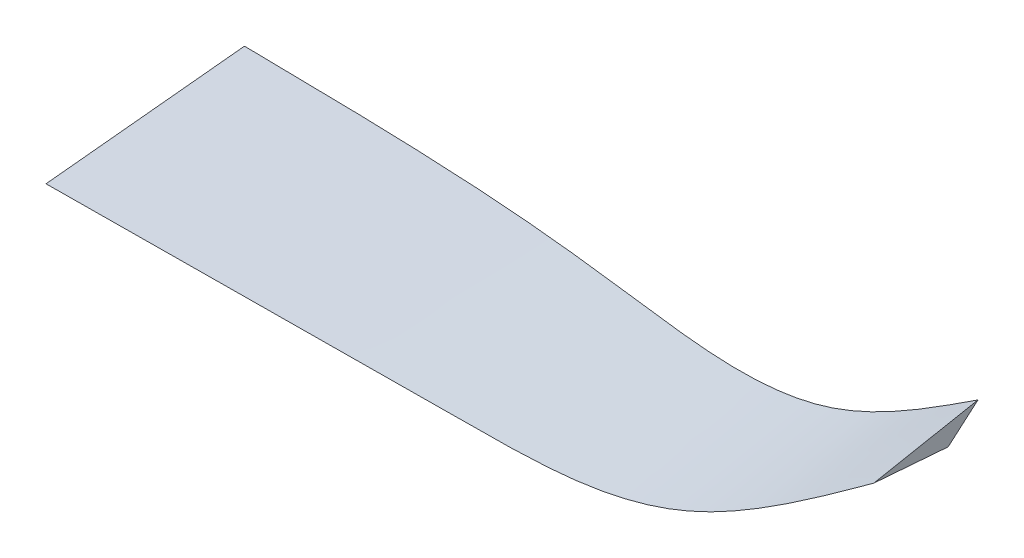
ISO-10303-21;
HEADER;
FILE_DESCRIPTION(('STEP AP214'),'2;1');
FILE_NAME('part.step','',(''),(''),'','','');
FILE_SCHEMA(('AUTOMOTIVE_DESIGN { 1 0 10303 214 1 1 1 1 }'));
ENDSEC;
DATA;
#1=APPLICATION_CONTEXT('core data for automotive mechanical design processes');
#2=APPLICATION_PROTOCOL_DEFINITION('international standard','automotive_design',2000,#1);
#3=PRODUCT_CONTEXT('',#1,'mechanical');
#4=PRODUCT('Part','Part','',(#3));
#5=PRODUCT_RELATED_PRODUCT_CATEGORY('part','',(#4));
#6=PRODUCT_DEFINITION_FORMATION('','',#4);
#7=PRODUCT_DEFINITION_CONTEXT('part definition',#1,'design');
#8=PRODUCT_DEFINITION('design','',#6,#7);
#9=PRODUCT_DEFINITION_SHAPE('','',#8);
#10=(LENGTH_UNIT() NAMED_UNIT(*) SI_UNIT(.MILLI.,.METRE.));
#11=(NAMED_UNIT(*) PLANE_ANGLE_UNIT() SI_UNIT($,.RADIAN.));
#12=(NAMED_UNIT(*) SI_UNIT($,.STERADIAN.) SOLID_ANGLE_UNIT());
#13=UNCERTAINTY_MEASURE_WITH_UNIT(LENGTH_MEASURE(1.E-05),#10,'distance_accuracy_value','');
#14=(GEOMETRIC_REPRESENTATION_CONTEXT(3) GLOBAL_UNCERTAINTY_ASSIGNED_CONTEXT((#13)) GLOBAL_UNIT_ASSIGNED_CONTEXT((#10,
#11,#12)) REPRESENTATION_CONTEXT('',''));
#15=CARTESIAN_POINT('',(0.,0.,0.));
#16=DIRECTION('',(0.,0.,1.));
#17=DIRECTION('',(1.,0.,0.));
#18=AXIS2_PLACEMENT_3D('',#15,#16,#17);
#19=CARTESIAN_POINT('',(89.1029294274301,11.9051930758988,-3.95485705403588));
#20=DIRECTION('',(1.,0.,0.));
#21=DIRECTION('',(0.,0.,-1.));
#22=AXIS2_PLACEMENT_3D('',#19,#20,#21);
#23=PLANE('',#22);
#24=DIRECTION('',(0.,-0.0772945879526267,-0.997008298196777));
#25=VECTOR('',#24,1.);
#26=CARTESIAN_POINT('',(89.1029294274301,12.57972698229,4.7458284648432));
#27=LINE('',#26,#25);
#28=CARTESIAN_POINT('',(89.1029294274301,12.57972698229,4.7458284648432));
#29=VERTEX_POINT('',#28);
#30=CARTESIAN_POINT('',(89.1029294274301,11.9051930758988,-3.95485705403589));
#31=VERTEX_POINT('',#30);
#32=EDGE_CURVE('E111',#29,#31,#27,.T.);
#33=ORIENTED_EDGE('',*,*,#32,.T.);
#34=DIRECTION('',(0.,0.652652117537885,-0.757657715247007));
#35=VECTOR('',#34,1.);
#36=CARTESIAN_POINT('',(89.1029294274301,11.9051930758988,-3.95485705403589));
#37=LINE('',#36,#35);
#38=CARTESIAN_POINT('',(89.1029294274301,14.9144835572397,-7.44831411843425));
#39=VERTEX_POINT('',#38);
#40=EDGE_CURVE('E95',#31,#39,#37,.T.);
#41=ORIENTED_EDGE('',*,*,#40,.T.);
#42=DIRECTION('',(0.,-0.18804958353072,0.982159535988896));
#43=VECTOR('',#42,1.);
#44=CARTESIAN_POINT('',(89.1029294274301,14.9144835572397,-7.44831411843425));
#45=LINE('',#44,#43);
#46=EDGE_CURVE('E100',#39,#29,#45,.T.);
#47=ORIENTED_EDGE('',*,*,#46,.T.);
#48=EDGE_LOOP('',(#33,#41,#47));
#49=FACE_BOUND('',#48,.T.);
#50=ADVANCED_FACE('F50',(#49),#23,.T.);
#51=CARTESIAN_POINT('',(0.,0.,-2.90022850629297));
#52=DIRECTION('',(1.,0.,0.));
#53=DIRECTION('',(0.,0.,-1.));
#54=AXIS2_PLACEMENT_3D('',#51,#52,#53);
#55=PLANE('',#54);
#56=DIRECTION('',(0.,-0.140021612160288,-0.990148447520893));
#57=VECTOR('',#56,1.);
#58=CARTESIAN_POINT('',(0.,2.16253073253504,12.3918854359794));
#59=LINE('',#58,#57);
#60=CARTESIAN_POINT('',(0.,2.16253073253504,12.3918854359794));
#61=VERTEX_POINT('',#60);
#62=CARTESIAN_POINT('',(0.,0.,-2.90022850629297));
#63=VERTEX_POINT('',#62);
#64=EDGE_CURVE('E155',#61,#63,#59,.T.);
#65=ORIENTED_EDGE('',*,*,#64,.F.);
#66=DIRECTION('',(0.,-0.100122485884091,0.994975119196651));
#67=VECTOR('',#66,1.);
#68=CARTESIAN_POINT('',(0.,4.49728730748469,-10.8099426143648));
#69=LINE('',#68,#67);
#70=CARTESIAN_POINT('',(0.,4.49728730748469,-10.8099426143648));
#71=VERTEX_POINT('',#70);
#72=EDGE_CURVE('E12',#71,#61,#69,.T.);
#73=ORIENTED_EDGE('',*,*,#72,.F.);
#74=DIRECTION('',(0.,0.494269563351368,-0.869308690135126));
#75=VECTOR('',#74,1.);
#76=CARTESIAN_POINT('',(0.,0.,-2.90022850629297));
#77=LINE('',#76,#75);
#78=EDGE_CURVE('E62',#63,#71,#77,.T.);
#79=ORIENTED_EDGE('',*,*,#78,.F.);
#80=EDGE_LOOP('',(#65,#73,#79));
#81=FACE_BOUND('',#80,.T.);
#82=ADVANCED_FACE('F52',(#81),#55,.F.);
#83=CARTESIAN_POINT('',(0.,2.16253073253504,12.3918854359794));
#84=CARTESIAN_POINT('',(0.712827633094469,2.16486686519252,12.3885701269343));
#85=CARTESIAN_POINT('',(2.13848425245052,2.16953913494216,12.3819395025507));
#86=CARTESIAN_POINT('',(4.12421902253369,2.17594442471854,12.3726210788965));
#87=CARTESIAN_POINT('',(5.957204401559,2.181721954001,12.3638958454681));
#88=CARTESIAN_POINT('',(7.80048011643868,2.1873702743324,12.3549711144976));
#89=CARTESIAN_POINT('',(9.80679427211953,2.19326705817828,12.3450191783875));
#90=CARTESIAN_POINT('',(11.8211870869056,2.1988299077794,12.3346844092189));
#91=CARTESIAN_POINT('',(13.6806255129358,2.20360965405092,12.3248014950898));
#92=CARTESIAN_POINT('',(15.3459779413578,2.20757311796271,12.3156421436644));
#93=CARTESIAN_POINT('',(16.9721952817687,2.21110890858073,12.3063722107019));
#94=CARTESIAN_POINT('',(18.5592790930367,2.21421384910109,12.2969876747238));
#95=CARTESIAN_POINT('',(20.1463634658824,2.21694210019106,12.2872344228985));
#96=CARTESIAN_POINT('',(22.0357713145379,2.21970479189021,12.2751473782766));
#97=CARTESIAN_POINT('',(24.2274974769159,2.22213085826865,12.2603614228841));
#98=CARTESIAN_POINT('',(26.6459075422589,2.22364133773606,12.2428978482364));
#99=CARTESIAN_POINT('',(28.8267589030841,2.2238991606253,12.2260607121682));
#100=CARTESIAN_POINT('',(30.8643227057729,2.22319041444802,12.2093920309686));
#101=CARTESIAN_POINT('',(32.8341943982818,2.22158085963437,12.1923636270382));
#102=CARTESIAN_POINT('',(34.7508313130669,2.21898652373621,12.1747775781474));
#103=CARTESIAN_POINT('',(36.5199959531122,2.21569109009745,12.1576544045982));
#104=CARTESIAN_POINT('',(38.3102040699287,2.21152235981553,12.1394952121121));
#105=CARTESIAN_POINT('',(40.116858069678,2.20628010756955,12.1201692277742));
#106=CARTESIAN_POINT('',(42.0912600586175,2.19941805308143,12.0978284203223));
#107=CARTESIAN_POINT('',(44.0650291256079,2.19108072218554,12.0744301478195));
#108=CARTESIAN_POINT('',(46.0382133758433,2.18219780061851,12.0489730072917));
#109=CARTESIAN_POINT('',(47.8596245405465,2.16996911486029,12.0261276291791));
#110=CARTESIAN_POINT('',(49.0607162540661,2.16008508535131,12.0112588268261));
#111=CARTESIAN_POINT('',(49.7744059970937,2.15481156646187,12.001709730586));
#112=CARTESIAN_POINT('',(50.5518343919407,2.14924103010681,11.9911105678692));
#113=CARTESIAN_POINT('',(51.7286597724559,2.14221790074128,11.9735949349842));
#114=CARTESIAN_POINT('',(52.9337943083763,2.14049660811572,11.9512661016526));
#115=CARTESIAN_POINT('',(53.5950806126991,2.14185900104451,11.9372895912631));
#116=CARTESIAN_POINT('',(54.7344826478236,2.14545961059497,11.9122803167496));
#117=CARTESIAN_POINT('',(56.5354833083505,2.16369593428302,11.8635259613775));
#118=CARTESIAN_POINT('',(58.3686956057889,2.21461473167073,11.7913993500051));
#119=CARTESIAN_POINT('',(59.3217707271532,2.25348353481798,11.7452846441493));
#120=CARTESIAN_POINT('',(59.7619593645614,2.27276053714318,11.7230741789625));
#121=CARTESIAN_POINT('',(60.2858928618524,2.2984720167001,11.6947356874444));
#122=CARTESIAN_POINT('',(60.7943083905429,2.32726731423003,11.6646107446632));
#123=CARTESIAN_POINT('',(61.1126406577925,2.34682979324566,11.6447066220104));
#124=CARTESIAN_POINT('',(61.2798105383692,2.35749525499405,11.6339878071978));
#125=CARTESIAN_POINT('',(61.4093246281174,2.36599639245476,11.625522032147));
#126=CARTESIAN_POINT('',(62.081881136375,2.41110256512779,11.5809092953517));
#127=CARTESIAN_POINT('',(63.1832004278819,2.49840377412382,11.4987638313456));
#128=CARTESIAN_POINT('',(64.3217389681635,2.61640347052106,11.395233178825));
#129=CARTESIAN_POINT('',(64.9200333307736,2.68676176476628,11.3353242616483));
#130=CARTESIAN_POINT('',(65.0924754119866,2.70762222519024,11.3176753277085));
#131=CARTESIAN_POINT('',(65.2261693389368,2.72414846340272,11.3037607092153));
#132=CARTESIAN_POINT('',(65.5423652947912,2.76388133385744,11.2704282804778));
#133=CARTESIAN_POINT('',(66.003645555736,2.82523480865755,11.2195868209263));
#134=CARTESIAN_POINT('',(66.5028641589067,2.89768366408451,11.1606441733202));
#135=CARTESIAN_POINT('',(66.8199033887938,2.94613914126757,11.1216365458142));
#136=CARTESIAN_POINT('',(66.9927755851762,2.97323494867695,11.0999334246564));
#137=CARTESIAN_POINT('',(67.1275152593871,2.99476798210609,11.0827519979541));
#138=CARTESIAN_POINT('',(67.791418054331,3.10246790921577,10.9970686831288));
#139=CARTESIAN_POINT('',(68.8723580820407,3.29867634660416,10.8442176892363));
#140=CARTESIAN_POINT('',(69.9797442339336,3.54164168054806,10.6611619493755));
#141=CARTESIAN_POINT('',(70.559653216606,3.68105507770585,10.5577953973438));
#142=CARTESIAN_POINT('',(70.7264776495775,3.72198997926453,10.5275508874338));
#143=CARTESIAN_POINT('',(70.8581203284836,3.75481534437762,10.5033645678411));
#144=CARTESIAN_POINT('',(71.1653947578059,3.83240789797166,10.4463161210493));
#145=CARTESIAN_POINT('',(71.6097546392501,3.94946307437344,10.3608643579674));
#146=CARTESIAN_POINT('',(72.0848303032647,4.08294098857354,10.2644919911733));
#147=CARTESIAN_POINT('',(72.3833065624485,4.17004892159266,10.202008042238));
#148=CARTESIAN_POINT('',(72.5430216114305,4.21750939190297,10.1680685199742));
#149=CARTESIAN_POINT('',(72.6683878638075,4.25529105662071,10.1411151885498));
#150=CARTESIAN_POINT('',(73.3044001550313,4.44907473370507,10.0031286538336));
#151=CARTESIAN_POINT('',(74.3403185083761,4.79351951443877,9.76134517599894));
#152=CARTESIAN_POINT('',(75.3856538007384,5.19226232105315,9.48813113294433));
#153=CARTESIAN_POINT('',(75.9252481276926,5.40955086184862,9.34072527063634));
#154=CARTESIAN_POINT('',(76.0633355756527,5.46580369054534,9.30264145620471));
#155=CARTESIAN_POINT('',(76.1682998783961,5.50892651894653,9.27349053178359));
#156=CARTESIAN_POINT('',(76.4601939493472,5.62959420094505,9.19200895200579));
#157=CARTESIAN_POINT('',(76.9018445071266,5.8171630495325,9.0659485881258));
#158=CARTESIAN_POINT('',(77.397108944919,6.03609714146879,8.91985134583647));
#159=CARTESIAN_POINT('',(77.7252974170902,6.1846830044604,8.82112321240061));
#160=CARTESIAN_POINT('',(78.7487837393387,6.65404793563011,8.50997020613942));
#161=CARTESIAN_POINT('',(80.3693398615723,7.45797308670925,7.98448452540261));
#162=CARTESIAN_POINT('',(81.9391018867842,8.31229190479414,7.43648150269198));
#163=CARTESIAN_POINT('',(82.6974765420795,8.73880395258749,7.16458095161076));
#164=CARTESIAN_POINT('',(83.3779972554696,9.12298951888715,6.91984030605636));
#165=CARTESIAN_POINT('',(84.4732363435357,9.75834233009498,6.51714539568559));
#166=CARTESIAN_POINT('',(86.1065701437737,10.7368393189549,5.90070872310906));
#167=CARTESIAN_POINT('',(87.6076156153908,11.6559723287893,5.3240809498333));
#168=CARTESIAN_POINT('',(88.6454642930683,12.2971203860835,4.92273470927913));
#169=CARTESIAN_POINT('',(89.1029294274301,12.57972698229,4.7458284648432));
#170=CARTESIAN_POINT('',(0.,0.,-2.90022850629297));
#171=CARTESIAN_POINT('',(0.712827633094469,-0.00282871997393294,-2.89818340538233));
#172=CARTESIAN_POINT('',(2.13848425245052,-0.00848616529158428,-2.89409319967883));
#173=CARTESIAN_POINT('',(4.12421902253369,-0.0162395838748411,-2.88846149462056));
#174=CARTESIAN_POINT('',(5.957204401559,-0.0232333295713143,-2.88337053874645));
#175=CARTESIAN_POINT('',(7.80048011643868,-0.030071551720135,-2.87838352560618));
#176=CARTESIAN_POINT('',(9.80679427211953,-0.037212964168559,-2.87316721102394));
#177=CARTESIAN_POINT('',(11.8211870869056,-0.0439544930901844,-2.8682375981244));
#178=CARTESIAN_POINT('',(13.6806255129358,-0.0497524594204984,-2.86399686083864));
#179=CARTESIAN_POINT('',(15.3459779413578,-0.0545658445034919,-2.86047755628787));
#180=CARTESIAN_POINT('',(16.9721952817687,-0.058866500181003,-2.8573365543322));
#181=CARTESIAN_POINT('',(18.5592790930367,-0.0626508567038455,-2.85457802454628));
#182=CARTESIAN_POINT('',(20.1463634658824,-0.0659856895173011,-2.85215507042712));
#183=CARTESIAN_POINT('',(22.0357713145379,-0.0693769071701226,-2.84970422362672));
#184=CARTESIAN_POINT('',(24.2274974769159,-0.0723821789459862,-2.84755895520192));
#185=CARTESIAN_POINT('',(26.6459075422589,-0.0743078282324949,-2.8462407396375));
#186=CARTESIAN_POINT('',(28.8267589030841,-0.0747285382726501,-2.84604783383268));
#187=CARTESIAN_POINT('',(30.8643227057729,-0.0739903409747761,-2.84672586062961));
#188=CARTESIAN_POINT('',(32.8341943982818,-0.072175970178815,-2.84821792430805));
#189=CARTESIAN_POINT('',(34.7508313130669,-0.0691854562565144,-2.85060209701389));
#190=CARTESIAN_POINT('',(36.5199959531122,-0.0653549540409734,-2.8536195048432));
#191=CARTESIAN_POINT('',(38.3102040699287,-0.0604774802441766,-2.85743410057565));
#192=CARTESIAN_POINT('',(40.116858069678,-0.0543602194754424,-2.86221004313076));
#193=CARTESIAN_POINT('',(42.0912600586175,-0.0461894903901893,-2.86851657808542));
#194=CARTESIAN_POINT('',(44.0650291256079,-0.0368329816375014,-2.87593532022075));
#195=CARTESIAN_POINT('',(46.0382133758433,-0.0246687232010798,-2.88473028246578));
#196=CARTESIAN_POINT('',(47.8596245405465,-0.015410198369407,-2.89382758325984));
#197=CARTESIAN_POINT('',(49.0607162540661,-0.00936549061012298,-2.9004919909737));
#198=CARTESIAN_POINT('',(49.7744059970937,-0.00472145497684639,-2.90474811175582));
#199=CARTESIAN_POINT('',(50.5518343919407,0.000637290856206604,-2.90946462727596));
#200=CARTESIAN_POINT('',(51.7286597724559,0.0109665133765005,-2.91715168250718));
#201=CARTESIAN_POINT('',(52.9337943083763,0.028122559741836,-2.92611639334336));
#202=CARTESIAN_POINT('',(53.5950806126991,0.0401122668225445,-2.9313960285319));
#203=CARTESIAN_POINT('',(54.7344826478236,0.062157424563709,-2.94068206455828));
#204=CARTESIAN_POINT('',(56.5354833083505,0.110718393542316,-2.95718594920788));
#205=CARTESIAN_POINT('',(58.3686956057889,0.193860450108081,-2.97777626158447));
#206=CARTESIAN_POINT('',(59.3217707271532,0.250166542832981,-2.98968184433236));
#207=CARTESIAN_POINT('',(59.7619593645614,0.277555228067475,-2.99530641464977));
#208=CARTESIAN_POINT('',(60.2858928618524,0.313047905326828,-3.00226043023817));
#209=CARTESIAN_POINT('',(60.7943083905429,0.351500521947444,-3.00935624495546));
#210=CARTESIAN_POINT('',(61.1126406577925,0.37717364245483,-3.01393428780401));
#211=CARTESIAN_POINT('',(61.2798105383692,0.39106421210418,-3.01637270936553));
#212=CARTESIAN_POINT('',(61.4093246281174,0.402073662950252,-3.01828253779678));
#213=CARTESIAN_POINT('',(62.081881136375,0.460244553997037,-3.02828313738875));
#214=CARTESIAN_POINT('',(63.1832004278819,0.569454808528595,-3.0458140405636));
#215=CARTESIAN_POINT('',(64.3217389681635,0.711209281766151,-3.06619171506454));
#216=CARTESIAN_POINT('',(64.9200333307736,0.794347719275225,-3.07753408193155));
#217=CARTESIAN_POINT('',(65.0924754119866,0.818915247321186,-3.08084717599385));
#218=CARTESIAN_POINT('',(65.2261693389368,0.838329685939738,-3.08344231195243));
#219=CARTESIAN_POINT('',(65.5423652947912,0.884919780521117,-3.08962834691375));
#220=CARTESIAN_POINT('',(66.003645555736,0.956416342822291,-3.09890511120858));
#221=CARTESIAN_POINT('',(66.5028641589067,1.04010617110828,-3.10938412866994));
#222=CARTESIAN_POINT('',(66.8199033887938,1.09581091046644,-3.11621337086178));
#223=CARTESIAN_POINT('',(66.9927755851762,1.12689029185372,-3.11998490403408));
#224=CARTESIAN_POINT('',(67.1275152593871,1.15154740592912,-3.12295367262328));
#225=CARTESIAN_POINT('',(67.791418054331,1.27471261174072,-3.13769379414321));
#226=CARTESIAN_POINT('',(68.8723580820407,1.49719437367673,-3.16315852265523));
#227=CARTESIAN_POINT('',(69.9797442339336,1.76869243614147,-3.19201408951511));
#228=CARTESIAN_POINT('',(70.559653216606,1.92353877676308,-3.20787766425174));
#229=CARTESIAN_POINT('',(70.7264776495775,1.9689578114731,-3.21249256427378));
#230=CARTESIAN_POINT('',(70.8581203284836,2.00534982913,-3.2161663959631));
#231=CARTESIAN_POINT('',(71.1653947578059,2.09132306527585,-3.22480132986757));
#232=CARTESIAN_POINT('',(71.6097546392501,2.22078258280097,-3.23758467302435));
#233=CARTESIAN_POINT('',(72.0848303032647,2.36811687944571,-3.2517505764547));
#234=CARTESIAN_POINT('',(72.3833065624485,2.46419388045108,-3.26084212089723));
#235=CARTESIAN_POINT('',(72.5430216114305,2.51652559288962,-3.26575679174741));
#236=CARTESIAN_POINT('',(72.6683878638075,2.55817719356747,-3.26964535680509));
#237=CARTESIAN_POINT('',(73.3044001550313,2.7717815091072,-3.28949530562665));
#238=CARTESIAN_POINT('',(74.3403185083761,3.15123309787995,-3.32351769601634));
#239=CARTESIAN_POINT('',(75.3856538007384,3.59113029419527,-3.36061191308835));
#240=CARTESIAN_POINT('',(75.9252481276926,3.83160350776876,-3.38037430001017));
#241=CARTESIAN_POINT('',(76.0633355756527,3.89388538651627,-3.38546596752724));
#242=CARTESIAN_POINT('',(76.1682998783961,3.94164762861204,-3.3893555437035));
#243=CARTESIAN_POINT('',(76.4601939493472,4.07533231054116,-3.40021152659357));
#244=CARTESIAN_POINT('',(76.9018445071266,4.28337071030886,-3.41690043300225));
#245=CARTESIAN_POINT('',(77.397108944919,4.52663401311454,-3.43606101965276));
#246=CARTESIAN_POINT('',(77.7252974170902,4.69192078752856,-3.44893711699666));
#247=CARTESIAN_POINT('',(78.7487837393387,5.21436750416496,-3.48939686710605));
#248=CARTESIAN_POINT('',(80.3693398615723,6.11283611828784,-3.55650020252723));
#249=CARTESIAN_POINT('',(81.9391018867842,7.07391492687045,-3.6250139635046));
#250=CARTESIAN_POINT('',(82.6974765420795,7.55479170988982,-3.65876515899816));
#251=CARTESIAN_POINT('',(83.3779972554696,7.98805982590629,-3.68911970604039));
#252=CARTESIAN_POINT('',(84.4732363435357,8.70589921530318,-3.73877154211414));
#253=CARTESIAN_POINT('',(86.1065701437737,9.8139668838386,-3.81425354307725));
#254=CARTESIAN_POINT('',(87.6076156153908,10.8564959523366,-3.884530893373));
#255=CARTESIAN_POINT('',(88.6454642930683,11.5843625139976,-3.93334199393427));
#256=CARTESIAN_POINT('',(89.1029294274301,11.9051930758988,-3.95485705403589));
#257=B_SPLINE_SURFACE_WITH_KNOTS('',1,3,((#83,#84,#85,#86,#87,#88,#89,#90,#91,#92,#93,#94,#95,
#96,#97,#98,#99,#100,#101,#102,#103,#104,#105,#106,#107,#108,#109,#110,#111,#112,#113,#114,#115,
#116,#117,#118,#119,#120,#121,#122,#123,#124,#125,#126,#127,#128,#129,#130,#131,#132,#133,#134,
#135,#136,#137,#138,#139,#140,#141,#142,#143,#144,#145,#146,#147,#148,#149,#150,#151,#152,#153,
#154,#155,#156,#157,#158,#159,#160,#161,#162,#163,#164,#165,#166,#167,#168,#169),(#170,#171,
#172,#173,#174,#175,#176,#177,#178,#179,#180,#181,#182,#183,#184,#185,#186,#187,#188,#189,#190,
#191,#192,#193,#194,#195,#196,#197,#198,#199,#200,#201,#202,#203,#204,#205,#206,#207,#208,#209,
#210,#211,#212,#213,#214,#215,#216,#217,#218,#219,#220,#221,#222,#223,#224,#225,#226,#227,#228,
#229,#230,#231,#232,#233,#234,#235,#236,#237,#238,#239,#240,#241,#242,#243,#244,#245,#246,#247,
#248,#249,#250,#251,#252,#253,#254,#255,#256)),.UNSPECIFIED.,.F.,.F.,.F.,(2,2),(4,1,1,1,1,1,1,1,
1,1,1,1,1,1,1,1,1,1,1,1,1,1,1,1,1,1,1,1,1,1,1,1,1,1,1,1,1,1,1,1,1,1,1,1,1,1,1,1,1,1,1,1,1,1,1,1,
1,1,1,1,1,1,1,1,1,1,1,1,1,1,1,1,1,1,1,1,1,1,1,1,1,1,1,1,4),(0.,1.),(0.,0.0232901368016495,
0.0465803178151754,0.0648798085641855,0.0831793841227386,0.106806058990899,0.130433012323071,
0.148997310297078,0.167561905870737,0.18484810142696,0.202134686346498,0.219421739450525,
0.236709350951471,0.263876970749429,0.29104669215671,0.315748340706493,0.335158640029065,
0.357651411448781,0.380147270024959,0.397825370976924,0.415506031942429,0.438698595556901,
0.456923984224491,0.480101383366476,0.503281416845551,0.521495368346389,0.539709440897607,
0.542588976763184,0.544851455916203,0.565151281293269,0.581100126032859,0.584286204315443,
0.586789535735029,0.618382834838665,0.643213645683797,0.646785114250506,0.649591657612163,
0.657629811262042,0.663948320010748,0.666254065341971,0.668066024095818,0.669429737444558,
0.670501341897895,0.690124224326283,0.70558174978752,0.707972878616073,0.709852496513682,
0.711270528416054,0.712385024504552,0.720290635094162,0.726514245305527,0.72891485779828,
0.730802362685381,0.732249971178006,0.733387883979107,0.752852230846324,0.768275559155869,
0.770615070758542,0.772455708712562,0.773922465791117,0.775075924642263,0.782877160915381,
0.789038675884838,0.791322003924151,0.7931190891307,0.794528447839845,0.795637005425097,
0.81503394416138,0.830545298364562,0.832651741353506,0.834309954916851,0.835487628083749,
0.836413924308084,0.844783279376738,0.851408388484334,0.854401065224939,0.856758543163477,
0.888851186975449,0.914670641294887,0.916529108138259,0.917990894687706,0.940846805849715,
0.958983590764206,0.981920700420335,1.),.UNSPECIFIED.);
#258=CARTESIAN_POINT('',(0.,0.,-2.90022850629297));
#259=CARTESIAN_POINT('',(0.712827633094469,-0.00282871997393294,-2.89818340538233));
#260=CARTESIAN_POINT('',(2.13848425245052,-0.00848616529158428,-2.89409319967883));
#261=CARTESIAN_POINT('',(4.12421902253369,-0.0162395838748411,-2.88846149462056));
#262=CARTESIAN_POINT('',(5.957204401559,-0.0232333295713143,-2.88337053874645));
#263=CARTESIAN_POINT('',(7.80048011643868,-0.030071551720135,-2.87838352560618));
#264=CARTESIAN_POINT('',(9.80679427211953,-0.037212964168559,-2.87316721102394));
#265=CARTESIAN_POINT('',(11.8211870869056,-0.0439544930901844,-2.8682375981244));
#266=CARTESIAN_POINT('',(13.6806255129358,-0.0497524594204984,-2.86399686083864));
#267=CARTESIAN_POINT('',(15.3459779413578,-0.0545658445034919,-2.86047755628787));
#268=CARTESIAN_POINT('',(16.9721952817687,-0.058866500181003,-2.8573365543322));
#269=CARTESIAN_POINT('',(18.5592790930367,-0.0626508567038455,-2.85457802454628));
#270=CARTESIAN_POINT('',(20.1463634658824,-0.0659856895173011,-2.85215507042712));
#271=CARTESIAN_POINT('',(22.0357713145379,-0.0693769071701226,-2.84970422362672));
#272=CARTESIAN_POINT('',(24.2274974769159,-0.0723821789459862,-2.84755895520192));
#273=CARTESIAN_POINT('',(26.6459075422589,-0.0743078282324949,-2.8462407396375));
#274=CARTESIAN_POINT('',(28.8267589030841,-0.0747285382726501,-2.84604783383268));
#275=CARTESIAN_POINT('',(30.8643227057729,-0.0739903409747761,-2.84672586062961));
#276=CARTESIAN_POINT('',(32.8341943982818,-0.072175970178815,-2.84821792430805));
#277=CARTESIAN_POINT('',(34.7508313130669,-0.0691854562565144,-2.85060209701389));
#278=CARTESIAN_POINT('',(36.5199959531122,-0.0653549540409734,-2.8536195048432));
#279=CARTESIAN_POINT('',(38.3102040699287,-0.0604774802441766,-2.85743410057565));
#280=CARTESIAN_POINT('',(40.116858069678,-0.0543602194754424,-2.86221004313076));
#281=CARTESIAN_POINT('',(42.0912600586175,-0.0461894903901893,-2.86851657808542));
#282=CARTESIAN_POINT('',(44.0650291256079,-0.0368329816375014,-2.87593532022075));
#283=CARTESIAN_POINT('',(46.0382133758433,-0.0246687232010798,-2.88473028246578));
#284=CARTESIAN_POINT('',(47.8596245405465,-0.015410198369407,-2.89382758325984));
#285=CARTESIAN_POINT('',(49.0607162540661,-0.00936549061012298,-2.9004919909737));
#286=CARTESIAN_POINT('',(49.7744059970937,-0.00472145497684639,-2.90474811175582));
#287=CARTESIAN_POINT('',(50.5518343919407,0.000637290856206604,-2.90946462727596));
#288=CARTESIAN_POINT('',(51.7286597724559,0.0109665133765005,-2.91715168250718));
#289=CARTESIAN_POINT('',(52.9337943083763,0.028122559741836,-2.92611639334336));
#290=CARTESIAN_POINT('',(53.5950806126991,0.0401122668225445,-2.9313960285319));
#291=CARTESIAN_POINT('',(54.7344826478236,0.062157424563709,-2.94068206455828));
#292=CARTESIAN_POINT('',(56.5354833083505,0.110718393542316,-2.95718594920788));
#293=CARTESIAN_POINT('',(58.3686956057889,0.193860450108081,-2.97777626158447));
#294=CARTESIAN_POINT('',(59.3217707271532,0.250166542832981,-2.98968184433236));
#295=CARTESIAN_POINT('',(59.7619593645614,0.277555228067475,-2.99530641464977));
#296=CARTESIAN_POINT('',(60.2858928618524,0.313047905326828,-3.00226043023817));
#297=CARTESIAN_POINT('',(60.7943083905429,0.351500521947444,-3.00935624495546));
#298=CARTESIAN_POINT('',(61.1126406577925,0.37717364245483,-3.01393428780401));
#299=CARTESIAN_POINT('',(61.2798105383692,0.39106421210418,-3.01637270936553));
#300=CARTESIAN_POINT('',(61.4093246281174,0.402073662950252,-3.01828253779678));
#301=CARTESIAN_POINT('',(62.081881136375,0.460244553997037,-3.02828313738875));
#302=CARTESIAN_POINT('',(63.1832004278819,0.569454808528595,-3.0458140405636));
#303=CARTESIAN_POINT('',(64.3217389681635,0.711209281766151,-3.06619171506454));
#304=CARTESIAN_POINT('',(64.9200333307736,0.794347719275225,-3.07753408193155));
#305=CARTESIAN_POINT('',(65.0924754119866,0.818915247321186,-3.08084717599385));
#306=CARTESIAN_POINT('',(65.2261693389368,0.838329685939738,-3.08344231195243));
#307=CARTESIAN_POINT('',(65.5423652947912,0.884919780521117,-3.08962834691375));
#308=CARTESIAN_POINT('',(66.003645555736,0.956416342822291,-3.09890511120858));
#309=CARTESIAN_POINT('',(66.5028641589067,1.04010617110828,-3.10938412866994));
#310=CARTESIAN_POINT('',(66.8199033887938,1.09581091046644,-3.11621337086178));
#311=CARTESIAN_POINT('',(66.9927755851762,1.12689029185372,-3.11998490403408));
#312=CARTESIAN_POINT('',(67.1275152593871,1.15154740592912,-3.12295367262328));
#313=CARTESIAN_POINT('',(67.791418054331,1.27471261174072,-3.13769379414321));
#314=CARTESIAN_POINT('',(68.8723580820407,1.49719437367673,-3.16315852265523));
#315=CARTESIAN_POINT('',(69.9797442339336,1.76869243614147,-3.19201408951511));
#316=CARTESIAN_POINT('',(70.559653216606,1.92353877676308,-3.20787766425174));
#317=CARTESIAN_POINT('',(70.7264776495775,1.9689578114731,-3.21249256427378));
#318=CARTESIAN_POINT('',(70.8581203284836,2.00534982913,-3.2161663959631));
#319=CARTESIAN_POINT('',(71.1653947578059,2.09132306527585,-3.22480132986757));
#320=CARTESIAN_POINT('',(71.6097546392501,2.22078258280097,-3.23758467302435));
#321=CARTESIAN_POINT('',(72.0848303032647,2.36811687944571,-3.2517505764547));
#322=CARTESIAN_POINT('',(72.3833065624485,2.46419388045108,-3.26084212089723));
#323=CARTESIAN_POINT('',(72.5430216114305,2.51652559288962,-3.26575679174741));
#324=CARTESIAN_POINT('',(72.6683878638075,2.55817719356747,-3.26964535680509));
#325=CARTESIAN_POINT('',(73.3044001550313,2.7717815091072,-3.28949530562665));
#326=CARTESIAN_POINT('',(74.3403185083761,3.15123309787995,-3.32351769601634));
#327=CARTESIAN_POINT('',(75.3856538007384,3.59113029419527,-3.36061191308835));
#328=CARTESIAN_POINT('',(75.9252481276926,3.83160350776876,-3.38037430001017));
#329=CARTESIAN_POINT('',(76.0633355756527,3.89388538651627,-3.38546596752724));
#330=CARTESIAN_POINT('',(76.1682998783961,3.94164762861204,-3.3893555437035));
#331=CARTESIAN_POINT('',(76.4601939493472,4.07533231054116,-3.40021152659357));
#332=CARTESIAN_POINT('',(76.9018445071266,4.28337071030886,-3.41690043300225));
#333=CARTESIAN_POINT('',(77.397108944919,4.52663401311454,-3.43606101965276));
#334=CARTESIAN_POINT('',(77.7252974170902,4.69192078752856,-3.44893711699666));
#335=CARTESIAN_POINT('',(78.7487837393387,5.21436750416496,-3.48939686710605));
#336=CARTESIAN_POINT('',(80.3693398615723,6.11283611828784,-3.55650020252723));
#337=CARTESIAN_POINT('',(81.9391018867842,7.07391492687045,-3.6250139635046));
#338=CARTESIAN_POINT('',(82.6974765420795,7.55479170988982,-3.65876515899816));
#339=CARTESIAN_POINT('',(83.3779972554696,7.98805982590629,-3.68911970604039));
#340=CARTESIAN_POINT('',(84.4732363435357,8.70589921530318,-3.73877154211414));
#341=CARTESIAN_POINT('',(86.1065701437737,9.8139668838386,-3.81425354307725));
#342=CARTESIAN_POINT('',(87.6076156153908,10.8564959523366,-3.884530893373));
#343=CARTESIAN_POINT('',(88.6454642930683,11.5843625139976,-3.93334199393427));
#344=CARTESIAN_POINT('',(89.1029294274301,11.9051930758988,-3.95485705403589));
#345=B_SPLINE_CURVE_WITH_KNOTS('',3,(#258,#259,#260,#261,#262,#263,#264,#265,#266,#267,#268,
#269,#270,#271,#272,#273,#274,#275,#276,#277,#278,#279,#280,#281,#282,#283,#284,#285,#286,#287,
#288,#289,#290,#291,#292,#293,#294,#295,#296,#297,#298,#299,#300,#301,#302,#303,#304,#305,#306,
#307,#308,#309,#310,#311,#312,#313,#314,#315,#316,#317,#318,#319,#320,#321,#322,#323,#324,#325,
#326,#327,#328,#329,#330,#331,#332,#333,#334,#335,#336,#337,#338,#339,#340,#341,#342,#343,#344),
.UNSPECIFIED.,.F.,.F.,(4,1,1,1,1,1,1,1,1,1,1,1,1,1,1,1,1,1,1,1,1,1,1,1,1,1,1,1,1,1,1,1,1,1,1,1,
1,1,1,1,1,1,1,1,1,1,1,1,1,1,1,1,1,1,1,1,1,1,1,1,1,1,1,1,1,1,1,1,1,1,1,1,1,1,1,1,1,1,1,1,1,1,1,1,
4),(0.,0.0232901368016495,0.0465803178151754,0.0648798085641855,0.0831793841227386,
0.106806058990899,0.130433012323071,0.148997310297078,0.167561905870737,0.18484810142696,
0.202134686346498,0.219421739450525,0.236709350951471,0.263876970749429,0.29104669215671,
0.315748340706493,0.335158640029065,0.357651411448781,0.380147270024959,0.397825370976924,
0.415506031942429,0.438698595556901,0.456923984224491,0.480101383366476,0.503281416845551,
0.521495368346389,0.539709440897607,0.542588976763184,0.544851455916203,0.565151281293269,
0.581100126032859,0.584286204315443,0.586789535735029,0.618382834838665,0.643213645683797,
0.646785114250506,0.649591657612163,0.657629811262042,0.663948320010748,0.666254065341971,
0.668066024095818,0.669429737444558,0.670501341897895,0.690124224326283,0.70558174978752,
0.707972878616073,0.709852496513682,0.711270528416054,0.712385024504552,0.720290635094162,
0.726514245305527,0.72891485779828,0.730802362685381,0.732249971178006,0.733387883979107,
0.752852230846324,0.768275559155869,0.770615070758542,0.772455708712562,0.773922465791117,
0.775075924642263,0.782877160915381,0.789038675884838,0.791322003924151,0.7931190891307,
0.794528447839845,0.795637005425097,0.81503394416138,0.830545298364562,0.832651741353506,
0.834309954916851,0.835487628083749,0.836413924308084,0.844783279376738,0.851408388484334,
0.854401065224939,0.856758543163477,0.888851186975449,0.914670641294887,0.916529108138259,
0.917990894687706,0.940846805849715,0.958983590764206,0.981920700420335,1.),.UNSPECIFIED.);
#346=EDGE_CURVE('E172',#63,#31,#345,.T.);
#347=CARTESIAN_POINT('',(0.,2.16253073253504,12.3918854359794));
#348=CARTESIAN_POINT('',(0.712827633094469,2.16486686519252,12.3885701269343));
#349=CARTESIAN_POINT('',(2.13848425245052,2.16953913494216,12.3819395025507));
#350=CARTESIAN_POINT('',(4.12421902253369,2.17594442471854,12.3726210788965));
#351=CARTESIAN_POINT('',(5.957204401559,2.181721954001,12.3638958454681));
#352=CARTESIAN_POINT('',(7.80048011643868,2.1873702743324,12.3549711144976));
#353=CARTESIAN_POINT('',(9.80679427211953,2.19326705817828,12.3450191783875));
#354=CARTESIAN_POINT('',(11.8211870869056,2.1988299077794,12.3346844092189));
#355=CARTESIAN_POINT('',(13.6806255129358,2.20360965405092,12.3248014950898));
#356=CARTESIAN_POINT('',(15.3459779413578,2.20757311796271,12.3156421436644));
#357=CARTESIAN_POINT('',(16.9721952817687,2.21110890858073,12.3063722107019));
#358=CARTESIAN_POINT('',(18.5592790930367,2.21421384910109,12.2969876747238));
#359=CARTESIAN_POINT('',(20.1463634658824,2.21694210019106,12.2872344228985));
#360=CARTESIAN_POINT('',(22.0357713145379,2.21970479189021,12.2751473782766));
#361=CARTESIAN_POINT('',(24.2274974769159,2.22213085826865,12.2603614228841));
#362=CARTESIAN_POINT('',(26.6459075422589,2.22364133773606,12.2428978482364));
#363=CARTESIAN_POINT('',(28.8267589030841,2.2238991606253,12.2260607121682));
#364=CARTESIAN_POINT('',(30.8643227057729,2.22319041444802,12.2093920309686));
#365=CARTESIAN_POINT('',(32.8341943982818,2.22158085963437,12.1923636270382));
#366=CARTESIAN_POINT('',(34.7508313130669,2.21898652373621,12.1747775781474));
#367=CARTESIAN_POINT('',(36.5199959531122,2.21569109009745,12.1576544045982));
#368=CARTESIAN_POINT('',(38.3102040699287,2.21152235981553,12.1394952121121));
#369=CARTESIAN_POINT('',(40.116858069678,2.20628010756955,12.1201692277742));
#370=CARTESIAN_POINT('',(42.0912600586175,2.19941805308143,12.0978284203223));
#371=CARTESIAN_POINT('',(44.0650291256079,2.19108072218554,12.0744301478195));
#372=CARTESIAN_POINT('',(46.0382133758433,2.18219780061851,12.0489730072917));
#373=CARTESIAN_POINT('',(47.8596245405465,2.16996911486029,12.0261276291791));
#374=CARTESIAN_POINT('',(49.0607162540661,2.16008508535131,12.0112588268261));
#375=CARTESIAN_POINT('',(49.7744059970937,2.15481156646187,12.001709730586));
#376=CARTESIAN_POINT('',(50.5518343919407,2.14924103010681,11.9911105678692));
#377=CARTESIAN_POINT('',(51.7286597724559,2.14221790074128,11.9735949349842));
#378=CARTESIAN_POINT('',(52.9337943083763,2.14049660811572,11.9512661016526));
#379=CARTESIAN_POINT('',(53.5950806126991,2.14185900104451,11.9372895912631));
#380=CARTESIAN_POINT('',(54.7344826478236,2.14545961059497,11.9122803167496));
#381=CARTESIAN_POINT('',(56.5354833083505,2.16369593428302,11.8635259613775));
#382=CARTESIAN_POINT('',(58.3686956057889,2.21461473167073,11.7913993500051));
#383=CARTESIAN_POINT('',(59.3217707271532,2.25348353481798,11.7452846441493));
#384=CARTESIAN_POINT('',(59.7619593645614,2.27276053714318,11.7230741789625));
#385=CARTESIAN_POINT('',(60.2858928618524,2.2984720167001,11.6947356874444));
#386=CARTESIAN_POINT('',(60.7943083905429,2.32726731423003,11.6646107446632));
#387=CARTESIAN_POINT('',(61.1126406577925,2.34682979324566,11.6447066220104));
#388=CARTESIAN_POINT('',(61.2798105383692,2.35749525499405,11.6339878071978));
#389=CARTESIAN_POINT('',(61.4093246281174,2.36599639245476,11.625522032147));
#390=CARTESIAN_POINT('',(62.081881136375,2.41110256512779,11.5809092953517));
#391=CARTESIAN_POINT('',(63.1832004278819,2.49840377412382,11.4987638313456));
#392=CARTESIAN_POINT('',(64.3217389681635,2.61640347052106,11.395233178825));
#393=CARTESIAN_POINT('',(64.9200333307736,2.68676176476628,11.3353242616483));
#394=CARTESIAN_POINT('',(65.0924754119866,2.70762222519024,11.3176753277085));
#395=CARTESIAN_POINT('',(65.2261693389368,2.72414846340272,11.3037607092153));
#396=CARTESIAN_POINT('',(65.5423652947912,2.76388133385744,11.2704282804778));
#397=CARTESIAN_POINT('',(66.003645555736,2.82523480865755,11.2195868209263));
#398=CARTESIAN_POINT('',(66.5028641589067,2.89768366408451,11.1606441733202));
#399=CARTESIAN_POINT('',(66.8199033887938,2.94613914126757,11.1216365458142));
#400=CARTESIAN_POINT('',(66.9927755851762,2.97323494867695,11.0999334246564));
#401=CARTESIAN_POINT('',(67.1275152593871,2.99476798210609,11.0827519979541));
#402=CARTESIAN_POINT('',(67.791418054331,3.10246790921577,10.9970686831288));
#403=CARTESIAN_POINT('',(68.8723580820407,3.29867634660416,10.8442176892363));
#404=CARTESIAN_POINT('',(69.9797442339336,3.54164168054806,10.6611619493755));
#405=CARTESIAN_POINT('',(70.559653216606,3.68105507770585,10.5577953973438));
#406=CARTESIAN_POINT('',(70.7264776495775,3.72198997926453,10.5275508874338));
#407=CARTESIAN_POINT('',(70.8581203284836,3.75481534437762,10.5033645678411));
#408=CARTESIAN_POINT('',(71.1653947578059,3.83240789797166,10.4463161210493));
#409=CARTESIAN_POINT('',(71.6097546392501,3.94946307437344,10.3608643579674));
#410=CARTESIAN_POINT('',(72.0848303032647,4.08294098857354,10.2644919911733));
#411=CARTESIAN_POINT('',(72.3833065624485,4.17004892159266,10.202008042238));
#412=CARTESIAN_POINT('',(72.5430216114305,4.21750939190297,10.1680685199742));
#413=CARTESIAN_POINT('',(72.6683878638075,4.25529105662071,10.1411151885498));
#414=CARTESIAN_POINT('',(73.3044001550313,4.44907473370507,10.0031286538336));
#415=CARTESIAN_POINT('',(74.3403185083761,4.79351951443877,9.76134517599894));
#416=CARTESIAN_POINT('',(75.3856538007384,5.19226232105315,9.48813113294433));
#417=CARTESIAN_POINT('',(75.9252481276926,5.40955086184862,9.34072527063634));
#418=CARTESIAN_POINT('',(76.0633355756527,5.46580369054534,9.30264145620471));
#419=CARTESIAN_POINT('',(76.1682998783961,5.50892651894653,9.27349053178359));
#420=CARTESIAN_POINT('',(76.4601939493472,5.62959420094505,9.19200895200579));
#421=CARTESIAN_POINT('',(76.9018445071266,5.8171630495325,9.0659485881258));
#422=CARTESIAN_POINT('',(77.397108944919,6.03609714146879,8.91985134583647));
#423=CARTESIAN_POINT('',(77.7252974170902,6.1846830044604,8.82112321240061));
#424=CARTESIAN_POINT('',(78.7487837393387,6.65404793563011,8.50997020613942));
#425=CARTESIAN_POINT('',(80.3693398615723,7.45797308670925,7.98448452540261));
#426=CARTESIAN_POINT('',(81.9391018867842,8.31229190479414,7.43648150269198));
#427=CARTESIAN_POINT('',(82.6974765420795,8.73880395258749,7.16458095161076));
#428=CARTESIAN_POINT('',(83.3779972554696,9.12298951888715,6.91984030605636));
#429=CARTESIAN_POINT('',(84.4732363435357,9.75834233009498,6.51714539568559));
#430=CARTESIAN_POINT('',(86.1065701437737,10.7368393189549,5.90070872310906));
#431=CARTESIAN_POINT('',(87.6076156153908,11.6559723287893,5.3240809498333));
#432=CARTESIAN_POINT('',(88.6454642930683,12.2971203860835,4.92273470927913));
#433=CARTESIAN_POINT('',(89.1029294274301,12.57972698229,4.7458284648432));
#434=B_SPLINE_CURVE_WITH_KNOTS('',3,(#347,#348,#349,#350,#351,#352,#353,#354,#355,#356,#357,
#358,#359,#360,#361,#362,#363,#364,#365,#366,#367,#368,#369,#370,#371,#372,#373,#374,#375,#376,
#377,#378,#379,#380,#381,#382,#383,#384,#385,#386,#387,#388,#389,#390,#391,#392,#393,#394,#395,
#396,#397,#398,#399,#400,#401,#402,#403,#404,#405,#406,#407,#408,#409,#410,#411,#412,#413,#414,
#415,#416,#417,#418,#419,#420,#421,#422,#423,#424,#425,#426,#427,#428,#429,#430,#431,#432,#433),
.UNSPECIFIED.,.F.,.F.,(4,1,1,1,1,1,1,1,1,1,1,1,1,1,1,1,1,1,1,1,1,1,1,1,1,1,1,1,1,1,1,1,1,1,1,1,
1,1,1,1,1,1,1,1,1,1,1,1,1,1,1,1,1,1,1,1,1,1,1,1,1,1,1,1,1,1,1,1,1,1,1,1,1,1,1,1,1,1,1,1,1,1,1,1,
4),(0.,0.0232901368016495,0.0465803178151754,0.0648798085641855,0.0831793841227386,
0.106806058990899,0.130433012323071,0.148997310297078,0.167561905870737,0.18484810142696,
0.202134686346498,0.219421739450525,0.236709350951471,0.263876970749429,0.29104669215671,
0.315748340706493,0.335158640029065,0.357651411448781,0.380147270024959,0.397825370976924,
0.415506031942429,0.438698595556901,0.456923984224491,0.480101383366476,0.503281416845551,
0.521495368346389,0.539709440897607,0.542588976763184,0.544851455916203,0.565151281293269,
0.581100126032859,0.584286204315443,0.586789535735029,0.618382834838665,0.643213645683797,
0.646785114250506,0.649591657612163,0.657629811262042,0.663948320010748,0.666254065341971,
0.668066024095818,0.669429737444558,0.670501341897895,0.690124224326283,0.70558174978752,
0.707972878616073,0.709852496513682,0.711270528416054,0.712385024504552,0.720290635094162,
0.726514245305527,0.72891485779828,0.730802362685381,0.732249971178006,0.733387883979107,
0.752852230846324,0.768275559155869,0.770615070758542,0.772455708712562,0.773922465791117,
0.775075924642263,0.782877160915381,0.789038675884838,0.791322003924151,0.7931190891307,
0.794528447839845,0.795637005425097,0.81503394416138,0.830545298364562,0.832651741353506,
0.834309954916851,0.835487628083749,0.836413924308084,0.844783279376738,0.851408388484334,
0.854401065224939,0.856758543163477,0.888851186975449,0.914670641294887,0.916529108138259,
0.917990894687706,0.940846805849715,0.958983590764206,0.981920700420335,1.),.UNSPECIFIED.);
#435=EDGE_CURVE('E70',#29,#61,#434,.F.);
#436=ORIENTED_EDGE('',*,*,#64,.T.);
#437=ORIENTED_EDGE('',*,*,#346,.T.);
#438=ORIENTED_EDGE('',*,*,#32,.F.);
#439=ORIENTED_EDGE('',*,*,#435,.T.);
#440=EDGE_LOOP('',(#436,#437,#438,#439));
#441=FACE_BOUND('',#440,.T.);
#442=ADVANCED_FACE('F198',(#441),#257,.T.);
#443=CARTESIAN_POINT('',(0.,0.,-2.90022850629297));
#444=CARTESIAN_POINT('',(0.712827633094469,-0.00282871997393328,-2.89818340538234));
#445=CARTESIAN_POINT('',(2.13848425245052,-0.00848616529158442,-2.89409319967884));
#446=CARTESIAN_POINT('',(4.12421902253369,-0.0162395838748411,-2.88846149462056));
#447=CARTESIAN_POINT('',(5.957204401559,-0.0232333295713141,-2.88337053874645));
#448=CARTESIAN_POINT('',(7.80048011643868,-0.0300715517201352,-2.87838352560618));
#449=CARTESIAN_POINT('',(9.80679427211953,-0.0372129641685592,-2.87316721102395));
#450=CARTESIAN_POINT('',(11.8211870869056,-0.0439544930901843,-2.86823759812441));
#451=CARTESIAN_POINT('',(13.6806255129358,-0.0497524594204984,-2.86399686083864));
#452=CARTESIAN_POINT('',(15.3459779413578,-0.0545658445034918,-2.86047755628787));
#453=CARTESIAN_POINT('',(16.9721952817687,-0.0588665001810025,-2.8573365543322));
#454=CARTESIAN_POINT('',(18.5592790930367,-0.0626508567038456,-2.85457802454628));
#455=CARTESIAN_POINT('',(20.1463634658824,-0.0659856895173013,-2.85215507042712));
#456=CARTESIAN_POINT('',(22.0357713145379,-0.0693769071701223,-2.84970422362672));
#457=CARTESIAN_POINT('',(24.2274974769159,-0.0723821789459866,-2.84755895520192));
#458=CARTESIAN_POINT('',(26.6459075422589,-0.0743078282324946,-2.8462407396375));
#459=CARTESIAN_POINT('',(28.8267589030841,-0.0747285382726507,-2.84604783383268));
#460=CARTESIAN_POINT('',(30.8643227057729,-0.0739903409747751,-2.8467258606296));
#461=CARTESIAN_POINT('',(32.8341943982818,-0.0721759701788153,-2.84821792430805));
#462=CARTESIAN_POINT('',(34.7508313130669,-0.0691854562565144,-2.85060209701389));
#463=CARTESIAN_POINT('',(36.5199959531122,-0.0653549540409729,-2.8536195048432));
#464=CARTESIAN_POINT('',(38.3102040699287,-0.0604774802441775,-2.85743410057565));
#465=CARTESIAN_POINT('',(40.116858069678,-0.0543602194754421,-2.86221004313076));
#466=CARTESIAN_POINT('',(42.0912600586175,-0.0461894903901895,-2.86851657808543));
#467=CARTESIAN_POINT('',(44.0650291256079,-0.0368329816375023,-2.87593532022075));
#468=CARTESIAN_POINT('',(46.0382133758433,-0.0246687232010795,-2.88473028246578));
#469=CARTESIAN_POINT('',(47.8596245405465,-0.0154101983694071,-2.89382758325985));
#470=CARTESIAN_POINT('',(49.0607162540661,-0.009365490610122,-2.90049199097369));
#471=CARTESIAN_POINT('',(49.7744059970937,-0.00472145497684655,-2.90474811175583));
#472=CARTESIAN_POINT('',(50.5518343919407,0.000637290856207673,-2.90946462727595));
#473=CARTESIAN_POINT('',(51.7286597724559,0.0109665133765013,-2.91715168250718));
#474=CARTESIAN_POINT('',(52.9337943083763,0.0281225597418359,-2.92611639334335));
#475=CARTESIAN_POINT('',(53.5950806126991,0.0401122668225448,-2.9313960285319));
#476=CARTESIAN_POINT('',(54.7344826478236,0.062157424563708,-2.94068206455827));
#477=CARTESIAN_POINT('',(56.5354833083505,0.110718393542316,-2.95718594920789));
#478=CARTESIAN_POINT('',(58.3686956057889,0.193860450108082,-2.97777626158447));
#479=CARTESIAN_POINT('',(59.3217707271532,0.250166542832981,-2.98968184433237));
#480=CARTESIAN_POINT('',(59.7619593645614,0.277555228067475,-2.99530641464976));
#481=CARTESIAN_POINT('',(60.2858928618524,0.313047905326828,-3.00226043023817));
#482=CARTESIAN_POINT('',(60.7943083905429,0.351500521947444,-3.00935624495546));
#483=CARTESIAN_POINT('',(61.1126406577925,0.37717364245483,-3.01393428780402));
#484=CARTESIAN_POINT('',(61.2798105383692,0.39106421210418,-3.01637270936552));
#485=CARTESIAN_POINT('',(61.4093246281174,0.402073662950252,-3.01828253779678));
#486=CARTESIAN_POINT('',(62.081881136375,0.460244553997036,-3.02828313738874));
#487=CARTESIAN_POINT('',(63.1832004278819,0.569454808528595,-3.04581404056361));
#488=CARTESIAN_POINT('',(64.3217389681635,0.711209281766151,-3.06619171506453));
#489=CARTESIAN_POINT('',(64.9200333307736,0.794347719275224,-3.07753408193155));
#490=CARTESIAN_POINT('',(65.0924754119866,0.818915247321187,-3.08084717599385));
#491=CARTESIAN_POINT('',(65.2261693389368,0.838329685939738,-3.08344231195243));
#492=CARTESIAN_POINT('',(65.5423652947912,0.884919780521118,-3.08962834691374));
#493=CARTESIAN_POINT('',(66.003645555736,0.956416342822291,-3.09890511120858));
#494=CARTESIAN_POINT('',(66.5028641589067,1.04010617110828,-3.10938412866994));
#495=CARTESIAN_POINT('',(66.8199033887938,1.09581091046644,-3.11621337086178));
#496=CARTESIAN_POINT('',(66.9927755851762,1.12689029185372,-3.11998490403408));
#497=CARTESIAN_POINT('',(67.1275152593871,1.15154740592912,-3.12295367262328));
#498=CARTESIAN_POINT('',(67.791418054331,1.27471261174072,-3.13769379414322));
#499=CARTESIAN_POINT('',(68.8723580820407,1.49719437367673,-3.16315852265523));
#500=CARTESIAN_POINT('',(69.9797442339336,1.76869243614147,-3.1920140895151));
#501=CARTESIAN_POINT('',(70.559653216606,1.92353877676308,-3.20787766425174));
#502=CARTESIAN_POINT('',(70.7264776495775,1.9689578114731,-3.21249256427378));
#503=CARTESIAN_POINT('',(70.8581203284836,2.00534982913,-3.2161663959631));
#504=CARTESIAN_POINT('',(71.1653947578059,2.09132306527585,-3.22480132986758));
#505=CARTESIAN_POINT('',(71.6097546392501,2.22078258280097,-3.23758467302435));
#506=CARTESIAN_POINT('',(72.0848303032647,2.36811687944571,-3.25175057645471));
#507=CARTESIAN_POINT('',(72.3833065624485,2.46419388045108,-3.26084212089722));
#508=CARTESIAN_POINT('',(72.5430216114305,2.51652559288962,-3.26575679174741));
#509=CARTESIAN_POINT('',(72.6683878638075,2.55817719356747,-3.26964535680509));
#510=CARTESIAN_POINT('',(73.3044001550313,2.77178150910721,-3.28949530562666));
#511=CARTESIAN_POINT('',(74.3403185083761,3.15123309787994,-3.32351769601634));
#512=CARTESIAN_POINT('',(75.3856538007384,3.59113029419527,-3.36061191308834));
#513=CARTESIAN_POINT('',(75.9252481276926,3.83160350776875,-3.38037430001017));
#514=CARTESIAN_POINT('',(76.0633355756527,3.89388538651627,-3.38546596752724));
#515=CARTESIAN_POINT('',(76.1682998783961,3.94164762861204,-3.3893555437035));
#516=CARTESIAN_POINT('',(76.4601939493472,4.07533231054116,-3.40021152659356));
#517=CARTESIAN_POINT('',(76.9018445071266,4.28337071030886,-3.41690043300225));
#518=CARTESIAN_POINT('',(77.397108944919,4.52663401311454,-3.43606101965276));
#519=CARTESIAN_POINT('',(77.7252974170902,4.69192078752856,-3.44893711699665));
#520=CARTESIAN_POINT('',(78.7487837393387,5.21436750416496,-3.48939686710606));
#521=CARTESIAN_POINT('',(80.3693398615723,6.11283611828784,-3.55650020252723));
#522=CARTESIAN_POINT('',(81.9391018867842,7.07391492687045,-3.62501396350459));
#523=CARTESIAN_POINT('',(82.6974765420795,7.55479170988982,-3.65876515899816));
#524=CARTESIAN_POINT('',(83.3779972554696,7.98805982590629,-3.68911970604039));
#525=CARTESIAN_POINT('',(84.4732363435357,8.70589921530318,-3.73877154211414));
#526=CARTESIAN_POINT('',(86.1065701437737,9.8139668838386,-3.81425354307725));
#527=CARTESIAN_POINT('',(87.6076156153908,10.8564959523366,-3.884530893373));
#528=CARTESIAN_POINT('',(88.6454642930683,11.5843625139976,-3.93334199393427));
#529=CARTESIAN_POINT('',(89.1029294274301,11.9051930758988,-3.95485705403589));
#530=CARTESIAN_POINT('',(0.,4.49728730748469,-10.8099426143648));
#531=CARTESIAN_POINT('',(0.712827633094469,4.49962601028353,-10.7983683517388));
#532=CARTESIAN_POINT('',(2.13848425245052,4.5043034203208,-10.7752198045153));
#533=CARTESIAN_POINT('',(4.12421902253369,4.51073964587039,-10.7419839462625));
#534=CARTESIAN_POINT('',(5.957204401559,4.51655589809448,-10.7096667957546));
#535=CARTESIAN_POINT('',(7.80048011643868,4.52225156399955,-10.6751491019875));
#536=CARTESIAN_POINT('',(9.80679427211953,4.52820707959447,-10.6343501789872));
#537=CARTESIAN_POINT('',(11.8211870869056,4.53383311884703,-10.5886955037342));
#538=CARTESIAN_POINT('',(13.6806255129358,4.53867124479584,-10.5418296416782));
#539=CARTESIAN_POINT('',(15.3459779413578,4.54268491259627,-10.4956022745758));
#540=CARTESIAN_POINT('',(16.9721952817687,4.54626572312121,-10.4459500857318));
#541=CARTESIAN_POINT('',(18.5592790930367,4.54940903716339,-10.3928079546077));
#542=CARTESIAN_POINT('',(20.1463634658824,4.55216820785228,-10.3345413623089));
#543=CARTESIAN_POINT('',(22.0357713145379,4.55495685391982,-10.2585513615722));
#544=CARTESIAN_POINT('',(24.2274974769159,4.5573921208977,-10.1597392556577));
#545=CARTESIAN_POINT('',(26.6459075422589,4.55888764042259,-10.034665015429));
#546=CARTESIAN_POINT('',(28.8267589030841,4.55911392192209,-9.90663129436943));
#547=CARTESIAN_POINT('',(30.8643227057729,4.5583630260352,-9.77390567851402));
#548=CARTESIAN_POINT('',(32.8341943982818,4.55670227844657,-9.63264033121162));
#549=CARTESIAN_POINT('',(34.7508313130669,4.55404768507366,-9.48138595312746));
#550=CARTESIAN_POINT('',(36.5199959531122,4.55069024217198,-9.32712578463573));
#551=CARTESIAN_POINT('',(38.3102040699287,4.54645818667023,-9.15913654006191));
#552=CARTESIAN_POINT('',(40.116858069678,4.54115170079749,-8.97731094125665));
#553=CARTESIAN_POINT('',(42.0912600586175,4.53424031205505,-8.76717376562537));
#554=CARTESIAN_POINT('',(44.0650291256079,4.52582208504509,-8.54757612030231));
#555=CARTESIAN_POINT('',(46.0382133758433,4.5170596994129,-8.31936809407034));
#556=CARTESIAN_POINT('',(47.8596245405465,4.50365326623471,-8.10543607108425));
#557=CARTESIAN_POINT('',(49.0607162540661,4.49382905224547,-7.96422178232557));
#558=CARTESIAN_POINT('',(49.7744059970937,4.48863267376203,-7.88072800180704));
#559=CARTESIAN_POINT('',(50.5518343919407,4.4831746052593,-7.78991238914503));
#560=CARTESIAN_POINT('',(51.7286597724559,4.47646766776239,-7.65344062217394));
#561=CARTESIAN_POINT('',(52.9337943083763,4.47512588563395,-7.51694241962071));
#562=CARTESIAN_POINT('',(53.5950806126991,4.47666484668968,-7.44335220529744));
#563=CARTESIAN_POINT('',(54.7344826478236,4.48055462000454,-7.31726399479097));
#564=CARTESIAN_POINT('',(56.5354833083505,4.49877790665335,-7.12495206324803));
#565=CARTESIAN_POINT('',(58.3686956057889,4.54930861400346,-6.94689794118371));
#566=CARTESIAN_POINT('',(59.3217707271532,4.58818912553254,-6.86017913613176));
#567=CARTESIAN_POINT('',(59.7619593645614,4.60746923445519,-6.82075179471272));
#568=CARTESIAN_POINT('',(60.2858928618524,4.63319169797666,-6.77511699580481));
#569=CARTESIAN_POINT('',(60.7943083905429,4.66200057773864,-6.73260064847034));
#570=CARTESIAN_POINT('',(61.1126406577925,4.68157132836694,-6.70667557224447));
#571=CARTESIAN_POINT('',(61.2798105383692,4.69224087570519,-6.69323846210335));
#572=CARTESIAN_POINT('',(61.4093246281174,4.70074490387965,-6.68293533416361));
#573=CARTESIAN_POINT('',(62.081881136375,4.74586536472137,-6.62986341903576));
#574=CARTESIAN_POINT('',(63.1832004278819,4.8331369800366,-6.54897993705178));
#575=CARTESIAN_POINT('',(64.3217389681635,4.95117450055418,-6.47748639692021));
#576=CARTESIAN_POINT('',(64.9200333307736,5.02148175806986,-6.44337255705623));
#577=CARTESIAN_POINT('',(65.0924754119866,5.04232735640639,-6.43378184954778));
#578=CARTESIAN_POINT('',(65.2261693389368,5.05884151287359,-6.42649208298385));
#579=CARTESIAN_POINT('',(65.5423652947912,5.09854554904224,-6.40951806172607));
#580=CARTESIAN_POINT('',(66.003645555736,5.15985676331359,-6.38615020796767));
#581=CARTESIAN_POINT('',(66.5028641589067,5.23227458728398,-6.36331516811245));
#582=CARTESIAN_POINT('',(66.8199033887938,5.28071946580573,-6.34979512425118));
#583=CARTESIAN_POINT('',(66.9927755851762,5.30781216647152,-6.34269272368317));
#584=CARTESIAN_POINT('',(67.1275152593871,5.32934469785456,-6.3373221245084));
#585=CARTESIAN_POINT('',(67.791418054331,5.43704675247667,-6.31149482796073));
#586=CARTESIAN_POINT('',(68.8723580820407,5.63348931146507,-6.27778560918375));
#587=CARTESIAN_POINT('',(69.9797442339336,5.87637123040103,-6.25919706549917));
#588=CARTESIAN_POINT('',(70.559653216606,6.01556498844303,-6.253811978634));
#589=CARTESIAN_POINT('',(70.7264776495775,6.05643397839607,-6.25256057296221));
#590=CARTESIAN_POINT('',(70.8581203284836,6.08920520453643,-6.25175960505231));
#591=CARTESIAN_POINT('',(71.1653947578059,6.16666959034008,-6.2502361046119));
#592=CARTESIAN_POINT('',(71.6097546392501,6.28353511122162,-6.24975187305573));
#593=CARTESIAN_POINT('',(72.0848303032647,6.41686463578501,-6.25214104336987));
#594=CARTESIAN_POINT('',(72.3833065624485,6.50391877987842,-6.25476087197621));
#595=CARTESIAN_POINT('',(72.5430216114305,6.55136219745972,-6.2564536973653));
#596=CARTESIAN_POINT('',(72.6683878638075,6.58913939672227,-6.25796318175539));
#597=CARTESIAN_POINT('',(73.3044001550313,6.78292492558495,-6.26633449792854));
#598=CARTESIAN_POINT('',(74.3403185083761,7.12851240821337,-6.29004094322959));
#599=CARTESIAN_POINT('',(75.3856538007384,7.52697638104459,-6.32928857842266));
#600=CARTESIAN_POINT('',(75.9252481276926,7.74431727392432,-6.35304261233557));
#601=CARTESIAN_POINT('',(76.0633355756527,7.8005800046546,-6.35931375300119));
#602=CARTESIAN_POINT('',(76.1682998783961,7.84371061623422,-6.36418897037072));
#603=CARTESIAN_POINT('',(76.4601939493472,7.96439876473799,-6.37796838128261));
#604=CARTESIAN_POINT('',(76.9018445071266,8.15199144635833,-6.40029647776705));
#605=CARTESIAN_POINT('',(77.397108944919,8.3709285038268,-6.42783420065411));
#606=CARTESIAN_POINT('',(77.7252974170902,8.51950613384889,-6.44708573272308));
#607=CARTESIAN_POINT('',(78.7487837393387,8.98882910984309,-6.50882845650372));
#608=CARTESIAN_POINT('',(80.3693398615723,9.79254201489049,-6.62353341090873));
#609=CARTESIAN_POINT('',(81.9391018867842,10.6472198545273,-6.75458081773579));
#610=CARTESIAN_POINT('',(82.6974765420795,11.0738368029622,-6.82152382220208));
#611=CARTESIAN_POINT('',(83.3779972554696,11.4581128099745,-6.88197610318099));
#612=CARTESIAN_POINT('',(84.4732363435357,12.0935393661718,-6.98372693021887));
#613=CARTESIAN_POINT('',(86.1065701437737,13.0719197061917,-7.14343792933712));
#614=CARTESIAN_POINT('',(87.6076156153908,13.9908018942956,-7.29525082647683));
#615=CARTESIAN_POINT('',(88.6454642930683,14.6318992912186,-7.40148707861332));
#616=CARTESIAN_POINT('',(89.1029294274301,14.9144835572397,-7.44831411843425));
#617=B_SPLINE_SURFACE_WITH_KNOTS('',1,3,((#443,#444,#445,#446,#447,#448,#449,#450,#451,#452,
#453,#454,#455,#456,#457,#458,#459,#460,#461,#462,#463,#464,#465,#466,#467,#468,#469,#470,#471,
#472,#473,#474,#475,#476,#477,#478,#479,#480,#481,#482,#483,#484,#485,#486,#487,#488,#489,#490,
#491,#492,#493,#494,#495,#496,#497,#498,#499,#500,#501,#502,#503,#504,#505,#506,#507,#508,#509,
#510,#511,#512,#513,#514,#515,#516,#517,#518,#519,#520,#521,#522,#523,#524,#525,#526,#527,#528,
#529),(#530,#531,#532,#533,#534,#535,#536,#537,#538,#539,#540,#541,#542,#543,#544,#545,#546,
#547,#548,#549,#550,#551,#552,#553,#554,#555,#556,#557,#558,#559,#560,#561,#562,#563,#564,#565,
#566,#567,#568,#569,#570,#571,#572,#573,#574,#575,#576,#577,#578,#579,#580,#581,#582,#583,#584,
#585,#586,#587,#588,#589,#590,#591,#592,#593,#594,#595,#596,#597,#598,#599,#600,#601,#602,#603,
#604,#605,#606,#607,#608,#609,#610,#611,#612,#613,#614,#615,#616)),.UNSPECIFIED.,.F.,.F.,.F.,(2,
2),(4,1,1,1,1,1,1,1,1,1,1,1,1,1,1,1,1,1,1,1,1,1,1,1,1,1,1,1,1,1,1,1,1,1,1,1,1,1,1,1,1,1,1,1,1,1,
1,1,1,1,1,1,1,1,1,1,1,1,1,1,1,1,1,1,1,1,1,1,1,1,1,1,1,1,1,1,1,1,1,1,1,1,1,1,4),(0.,1.),(0.,
0.0232901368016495,0.0465803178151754,0.0648798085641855,0.0831793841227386,0.106806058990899,
0.130433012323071,0.148997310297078,0.167561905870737,0.18484810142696,0.202134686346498,
0.219421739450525,0.236709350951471,0.263876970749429,0.29104669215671,0.315748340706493,
0.335158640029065,0.357651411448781,0.380147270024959,0.397825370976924,0.415506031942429,
0.438698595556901,0.456923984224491,0.480101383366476,0.503281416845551,0.521495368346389,
0.539709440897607,0.542588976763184,0.544851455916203,0.565151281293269,0.581100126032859,
0.584286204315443,0.586789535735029,0.618382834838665,0.643213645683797,0.646785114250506,
0.649591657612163,0.657629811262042,0.663948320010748,0.666254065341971,0.668066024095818,
0.669429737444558,0.670501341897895,0.690124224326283,0.70558174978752,0.707972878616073,
0.709852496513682,0.711270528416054,0.712385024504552,0.720290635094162,0.726514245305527,
0.72891485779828,0.730802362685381,0.732249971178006,0.733387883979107,0.752852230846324,
0.768275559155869,0.770615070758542,0.772455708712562,0.773922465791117,0.775075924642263,
0.782877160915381,0.789038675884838,0.791322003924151,0.7931190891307,0.794528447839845,
0.795637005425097,0.81503394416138,0.830545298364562,0.832651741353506,0.834309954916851,
0.835487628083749,0.836413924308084,0.844783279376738,0.851408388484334,0.854401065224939,
0.856758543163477,0.888851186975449,0.914670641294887,0.916529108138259,0.917990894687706,
0.940846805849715,0.958983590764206,0.981920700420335,1.),.UNSPECIFIED.);
#618=CARTESIAN_POINT('',(0.,4.49728730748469,-10.8099426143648));
#619=CARTESIAN_POINT('',(0.712827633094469,4.49962601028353,-10.7983683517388));
#620=CARTESIAN_POINT('',(2.13848425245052,4.5043034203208,-10.7752198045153));
#621=CARTESIAN_POINT('',(4.12421902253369,4.51073964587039,-10.7419839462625));
#622=CARTESIAN_POINT('',(5.957204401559,4.51655589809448,-10.7096667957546));
#623=CARTESIAN_POINT('',(7.80048011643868,4.52225156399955,-10.6751491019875));
#624=CARTESIAN_POINT('',(9.80679427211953,4.52820707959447,-10.6343501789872));
#625=CARTESIAN_POINT('',(11.8211870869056,4.53383311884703,-10.5886955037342));
#626=CARTESIAN_POINT('',(13.6806255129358,4.53867124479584,-10.5418296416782));
#627=CARTESIAN_POINT('',(15.3459779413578,4.54268491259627,-10.4956022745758));
#628=CARTESIAN_POINT('',(16.9721952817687,4.54626572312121,-10.4459500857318));
#629=CARTESIAN_POINT('',(18.5592790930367,4.54940903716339,-10.3928079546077));
#630=CARTESIAN_POINT('',(20.1463634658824,4.55216820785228,-10.3345413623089));
#631=CARTESIAN_POINT('',(22.0357713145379,4.55495685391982,-10.2585513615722));
#632=CARTESIAN_POINT('',(24.2274974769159,4.5573921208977,-10.1597392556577));
#633=CARTESIAN_POINT('',(26.6459075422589,4.55888764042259,-10.034665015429));
#634=CARTESIAN_POINT('',(28.8267589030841,4.55911392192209,-9.90663129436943));
#635=CARTESIAN_POINT('',(30.8643227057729,4.5583630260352,-9.77390567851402));
#636=CARTESIAN_POINT('',(32.8341943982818,4.55670227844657,-9.63264033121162));
#637=CARTESIAN_POINT('',(34.7508313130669,4.55404768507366,-9.48138595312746));
#638=CARTESIAN_POINT('',(36.5199959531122,4.55069024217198,-9.32712578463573));
#639=CARTESIAN_POINT('',(38.3102040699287,4.54645818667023,-9.15913654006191));
#640=CARTESIAN_POINT('',(40.116858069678,4.54115170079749,-8.97731094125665));
#641=CARTESIAN_POINT('',(42.0912600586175,4.53424031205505,-8.76717376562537));
#642=CARTESIAN_POINT('',(44.0650291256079,4.52582208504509,-8.54757612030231));
#643=CARTESIAN_POINT('',(46.0382133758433,4.5170596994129,-8.31936809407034));
#644=CARTESIAN_POINT('',(47.8596245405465,4.50365326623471,-8.10543607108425));
#645=CARTESIAN_POINT('',(49.0607162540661,4.49382905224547,-7.96422178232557));
#646=CARTESIAN_POINT('',(49.7744059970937,4.48863267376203,-7.88072800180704));
#647=CARTESIAN_POINT('',(50.5518343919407,4.4831746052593,-7.78991238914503));
#648=CARTESIAN_POINT('',(51.7286597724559,4.47646766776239,-7.65344062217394));
#649=CARTESIAN_POINT('',(52.9337943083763,4.47512588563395,-7.51694241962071));
#650=CARTESIAN_POINT('',(53.5950806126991,4.47666484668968,-7.44335220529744));
#651=CARTESIAN_POINT('',(54.7344826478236,4.48055462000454,-7.31726399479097));
#652=CARTESIAN_POINT('',(56.5354833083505,4.49877790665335,-7.12495206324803));
#653=CARTESIAN_POINT('',(58.3686956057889,4.54930861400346,-6.94689794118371));
#654=CARTESIAN_POINT('',(59.3217707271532,4.58818912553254,-6.86017913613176));
#655=CARTESIAN_POINT('',(59.7619593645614,4.60746923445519,-6.82075179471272));
#656=CARTESIAN_POINT('',(60.2858928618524,4.63319169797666,-6.77511699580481));
#657=CARTESIAN_POINT('',(60.7943083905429,4.66200057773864,-6.73260064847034));
#658=CARTESIAN_POINT('',(61.1126406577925,4.68157132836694,-6.70667557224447));
#659=CARTESIAN_POINT('',(61.2798105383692,4.69224087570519,-6.69323846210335));
#660=CARTESIAN_POINT('',(61.4093246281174,4.70074490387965,-6.68293533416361));
#661=CARTESIAN_POINT('',(62.081881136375,4.74586536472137,-6.62986341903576));
#662=CARTESIAN_POINT('',(63.1832004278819,4.8331369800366,-6.54897993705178));
#663=CARTESIAN_POINT('',(64.3217389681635,4.95117450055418,-6.47748639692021));
#664=CARTESIAN_POINT('',(64.9200333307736,5.02148175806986,-6.44337255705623));
#665=CARTESIAN_POINT('',(65.0924754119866,5.04232735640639,-6.43378184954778));
#666=CARTESIAN_POINT('',(65.2261693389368,5.05884151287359,-6.42649208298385));
#667=CARTESIAN_POINT('',(65.5423652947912,5.09854554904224,-6.40951806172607));
#668=CARTESIAN_POINT('',(66.003645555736,5.15985676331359,-6.38615020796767));
#669=CARTESIAN_POINT('',(66.5028641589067,5.23227458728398,-6.36331516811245));
#670=CARTESIAN_POINT('',(66.8199033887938,5.28071946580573,-6.34979512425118));
#671=CARTESIAN_POINT('',(66.9927755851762,5.30781216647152,-6.34269272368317));
#672=CARTESIAN_POINT('',(67.1275152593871,5.32934469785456,-6.3373221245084));
#673=CARTESIAN_POINT('',(67.791418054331,5.43704675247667,-6.31149482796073));
#674=CARTESIAN_POINT('',(68.8723580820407,5.63348931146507,-6.27778560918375));
#675=CARTESIAN_POINT('',(69.9797442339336,5.87637123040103,-6.25919706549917));
#676=CARTESIAN_POINT('',(70.559653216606,6.01556498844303,-6.253811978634));
#677=CARTESIAN_POINT('',(70.7264776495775,6.05643397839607,-6.25256057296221));
#678=CARTESIAN_POINT('',(70.8581203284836,6.08920520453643,-6.25175960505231));
#679=CARTESIAN_POINT('',(71.1653947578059,6.16666959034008,-6.2502361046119));
#680=CARTESIAN_POINT('',(71.6097546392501,6.28353511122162,-6.24975187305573));
#681=CARTESIAN_POINT('',(72.0848303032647,6.41686463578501,-6.25214104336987));
#682=CARTESIAN_POINT('',(72.3833065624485,6.50391877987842,-6.25476087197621));
#683=CARTESIAN_POINT('',(72.5430216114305,6.55136219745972,-6.2564536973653));
#684=CARTESIAN_POINT('',(72.6683878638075,6.58913939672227,-6.25796318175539));
#685=CARTESIAN_POINT('',(73.3044001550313,6.78292492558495,-6.26633449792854));
#686=CARTESIAN_POINT('',(74.3403185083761,7.12851240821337,-6.29004094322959));
#687=CARTESIAN_POINT('',(75.3856538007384,7.52697638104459,-6.32928857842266));
#688=CARTESIAN_POINT('',(75.9252481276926,7.74431727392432,-6.35304261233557));
#689=CARTESIAN_POINT('',(76.0633355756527,7.8005800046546,-6.35931375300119));
#690=CARTESIAN_POINT('',(76.1682998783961,7.84371061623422,-6.36418897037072));
#691=CARTESIAN_POINT('',(76.4601939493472,7.96439876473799,-6.37796838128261));
#692=CARTESIAN_POINT('',(76.9018445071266,8.15199144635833,-6.40029647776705));
#693=CARTESIAN_POINT('',(77.397108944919,8.3709285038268,-6.42783420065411));
#694=CARTESIAN_POINT('',(77.7252974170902,8.51950613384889,-6.44708573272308));
#695=CARTESIAN_POINT('',(78.7487837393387,8.98882910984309,-6.50882845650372));
#696=CARTESIAN_POINT('',(80.3693398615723,9.79254201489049,-6.62353341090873));
#697=CARTESIAN_POINT('',(81.9391018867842,10.6472198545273,-6.75458081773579));
#698=CARTESIAN_POINT('',(82.6974765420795,11.0738368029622,-6.82152382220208));
#699=CARTESIAN_POINT('',(83.3779972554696,11.4581128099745,-6.88197610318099));
#700=CARTESIAN_POINT('',(84.4732363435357,12.0935393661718,-6.98372693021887));
#701=CARTESIAN_POINT('',(86.1065701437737,13.0719197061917,-7.14343792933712));
#702=CARTESIAN_POINT('',(87.6076156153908,13.9908018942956,-7.29525082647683));
#703=CARTESIAN_POINT('',(88.6454642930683,14.6318992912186,-7.40148707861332));
#704=CARTESIAN_POINT('',(89.1029294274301,14.9144835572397,-7.44831411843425));
#705=B_SPLINE_CURVE_WITH_KNOTS('',3,(#618,#619,#620,#621,#622,#623,#624,#625,#626,#627,#628,
#629,#630,#631,#632,#633,#634,#635,#636,#637,#638,#639,#640,#641,#642,#643,#644,#645,#646,#647,
#648,#649,#650,#651,#652,#653,#654,#655,#656,#657,#658,#659,#660,#661,#662,#663,#664,#665,#666,
#667,#668,#669,#670,#671,#672,#673,#674,#675,#676,#677,#678,#679,#680,#681,#682,#683,#684,#685,
#686,#687,#688,#689,#690,#691,#692,#693,#694,#695,#696,#697,#698,#699,#700,#701,#702,#703,#704),
.UNSPECIFIED.,.F.,.F.,(4,1,1,1,1,1,1,1,1,1,1,1,1,1,1,1,1,1,1,1,1,1,1,1,1,1,1,1,1,1,1,1,1,1,1,1,
1,1,1,1,1,1,1,1,1,1,1,1,1,1,1,1,1,1,1,1,1,1,1,1,1,1,1,1,1,1,1,1,1,1,1,1,1,1,1,1,1,1,1,1,1,1,1,1,
4),(0.,0.0232901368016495,0.0465803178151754,0.0648798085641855,0.0831793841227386,
0.106806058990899,0.130433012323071,0.148997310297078,0.167561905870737,0.18484810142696,
0.202134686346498,0.219421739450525,0.236709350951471,0.263876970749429,0.29104669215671,
0.315748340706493,0.335158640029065,0.357651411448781,0.380147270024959,0.397825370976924,
0.415506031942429,0.438698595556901,0.456923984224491,0.480101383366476,0.503281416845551,
0.521495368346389,0.539709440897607,0.542588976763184,0.544851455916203,0.565151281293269,
0.581100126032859,0.584286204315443,0.586789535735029,0.618382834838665,0.643213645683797,
0.646785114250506,0.649591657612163,0.657629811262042,0.663948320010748,0.666254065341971,
0.668066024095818,0.669429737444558,0.670501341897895,0.690124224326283,0.70558174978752,
0.707972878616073,0.709852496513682,0.711270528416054,0.712385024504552,0.720290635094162,
0.726514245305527,0.72891485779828,0.730802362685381,0.732249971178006,0.733387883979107,
0.752852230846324,0.768275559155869,0.770615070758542,0.772455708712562,0.773922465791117,
0.775075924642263,0.782877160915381,0.789038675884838,0.791322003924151,0.7931190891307,
0.794528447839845,0.795637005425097,0.81503394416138,0.830545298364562,0.832651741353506,
0.834309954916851,0.835487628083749,0.836413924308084,0.844783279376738,0.851408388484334,
0.854401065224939,0.856758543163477,0.888851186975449,0.914670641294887,0.916529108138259,
0.917990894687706,0.940846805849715,0.958983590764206,0.981920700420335,1.),.UNSPECIFIED.);
#706=EDGE_CURVE('E90',#71,#39,#705,.T.);
#707=ORIENTED_EDGE('',*,*,#78,.T.);
#708=ORIENTED_EDGE('',*,*,#706,.T.);
#709=ORIENTED_EDGE('',*,*,#40,.F.);
#710=ORIENTED_EDGE('',*,*,#346,.F.);
#711=EDGE_LOOP('',(#707,#708,#709,#710));
#712=FACE_BOUND('',#711,.T.);
#713=ADVANCED_FACE('F92',(#712),#617,.T.);
#714=CARTESIAN_POINT('',(0.,4.49728730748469,-10.8099426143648));
#715=CARTESIAN_POINT('',(0.712827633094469,4.49962601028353,-10.7983683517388));
#716=CARTESIAN_POINT('',(2.13848425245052,4.5043034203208,-10.7752198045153));
#717=CARTESIAN_POINT('',(4.12421902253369,4.51073964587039,-10.7419839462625));
#718=CARTESIAN_POINT('',(5.957204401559,4.51655589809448,-10.7096667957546));
#719=CARTESIAN_POINT('',(7.80048011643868,4.52225156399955,-10.6751491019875));
#720=CARTESIAN_POINT('',(9.80679427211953,4.52820707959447,-10.6343501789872));
#721=CARTESIAN_POINT('',(11.8211870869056,4.53383311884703,-10.5886955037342));
#722=CARTESIAN_POINT('',(13.6806255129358,4.53867124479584,-10.5418296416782));
#723=CARTESIAN_POINT('',(15.3459779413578,4.54268491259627,-10.4956022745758));
#724=CARTESIAN_POINT('',(16.9721952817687,4.54626572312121,-10.4459500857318));
#725=CARTESIAN_POINT('',(18.5592790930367,4.54940903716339,-10.3928079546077));
#726=CARTESIAN_POINT('',(20.1463634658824,4.55216820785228,-10.3345413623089));
#727=CARTESIAN_POINT('',(22.0357713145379,4.55495685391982,-10.2585513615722));
#728=CARTESIAN_POINT('',(24.2274974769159,4.5573921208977,-10.1597392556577));
#729=CARTESIAN_POINT('',(26.6459075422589,4.55888764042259,-10.034665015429));
#730=CARTESIAN_POINT('',(28.8267589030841,4.55911392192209,-9.90663129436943));
#731=CARTESIAN_POINT('',(30.8643227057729,4.5583630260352,-9.77390567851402));
#732=CARTESIAN_POINT('',(32.8341943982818,4.55670227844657,-9.63264033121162));
#733=CARTESIAN_POINT('',(34.7508313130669,4.55404768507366,-9.48138595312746));
#734=CARTESIAN_POINT('',(36.5199959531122,4.55069024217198,-9.32712578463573));
#735=CARTESIAN_POINT('',(38.3102040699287,4.54645818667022,-9.15913654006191));
#736=CARTESIAN_POINT('',(40.116858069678,4.54115170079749,-8.97731094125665));
#737=CARTESIAN_POINT('',(42.0912600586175,4.53424031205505,-8.76717376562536));
#738=CARTESIAN_POINT('',(44.0650291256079,4.52582208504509,-8.54757612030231));
#739=CARTESIAN_POINT('',(46.0382133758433,4.5170596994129,-8.31936809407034));
#740=CARTESIAN_POINT('',(47.8596245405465,4.50365326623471,-8.10543607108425));
#741=CARTESIAN_POINT('',(49.0607162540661,4.49382905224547,-7.96422178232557));
#742=CARTESIAN_POINT('',(49.7744059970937,4.48863267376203,-7.88072800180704));
#743=CARTESIAN_POINT('',(50.5518343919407,4.48317460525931,-7.78991238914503));
#744=CARTESIAN_POINT('',(51.7286597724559,4.47646766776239,-7.65344062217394));
#745=CARTESIAN_POINT('',(52.9337943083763,4.47512588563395,-7.5169424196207));
#746=CARTESIAN_POINT('',(53.5950806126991,4.47666484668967,-7.44335220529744));
#747=CARTESIAN_POINT('',(54.7344826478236,4.48055462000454,-7.31726399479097));
#748=CARTESIAN_POINT('',(56.5354833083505,4.49877790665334,-7.12495206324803));
#749=CARTESIAN_POINT('',(58.3686956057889,4.54930861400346,-6.9468979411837));
#750=CARTESIAN_POINT('',(59.3217707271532,4.58818912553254,-6.86017913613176));
#751=CARTESIAN_POINT('',(59.7619593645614,4.60746923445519,-6.82075179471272));
#752=CARTESIAN_POINT('',(60.2858928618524,4.63319169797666,-6.77511699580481));
#753=CARTESIAN_POINT('',(60.7943083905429,4.66200057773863,-6.73260064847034));
#754=CARTESIAN_POINT('',(61.1126406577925,4.68157132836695,-6.70667557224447));
#755=CARTESIAN_POINT('',(61.2798105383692,4.69224087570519,-6.69323846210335));
#756=CARTESIAN_POINT('',(61.4093246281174,4.70074490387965,-6.68293533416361));
#757=CARTESIAN_POINT('',(62.081881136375,4.74586536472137,-6.62986341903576));
#758=CARTESIAN_POINT('',(63.1832004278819,4.8331369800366,-6.54897993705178));
#759=CARTESIAN_POINT('',(64.3217389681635,4.95117450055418,-6.47748639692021));
#760=CARTESIAN_POINT('',(64.9200333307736,5.02148175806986,-6.44337255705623));
#761=CARTESIAN_POINT('',(65.0924754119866,5.04232735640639,-6.43378184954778));
#762=CARTESIAN_POINT('',(65.2261693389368,5.05884151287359,-6.42649208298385));
#763=CARTESIAN_POINT('',(65.5423652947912,5.09854554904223,-6.40951806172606));
#764=CARTESIAN_POINT('',(66.003645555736,5.1598567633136,-6.38615020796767));
#765=CARTESIAN_POINT('',(66.5028641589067,5.23227458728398,-6.36331516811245));
#766=CARTESIAN_POINT('',(66.8199033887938,5.28071946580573,-6.34979512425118));
#767=CARTESIAN_POINT('',(66.9927755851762,5.30781216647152,-6.34269272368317));
#768=CARTESIAN_POINT('',(67.1275152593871,5.32934469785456,-6.3373221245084));
#769=CARTESIAN_POINT('',(67.791418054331,5.43704675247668,-6.31149482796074));
#770=CARTESIAN_POINT('',(68.8723580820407,5.63348931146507,-6.27778560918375));
#771=CARTESIAN_POINT('',(69.9797442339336,5.87637123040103,-6.25919706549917));
#772=CARTESIAN_POINT('',(70.559653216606,6.01556498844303,-6.253811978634));
#773=CARTESIAN_POINT('',(70.7264776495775,6.05643397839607,-6.25256057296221));
#774=CARTESIAN_POINT('',(70.8581203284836,6.08920520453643,-6.25175960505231));
#775=CARTESIAN_POINT('',(71.1653947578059,6.16666959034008,-6.2502361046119));
#776=CARTESIAN_POINT('',(71.6097546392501,6.28353511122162,-6.24975187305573));
#777=CARTESIAN_POINT('',(72.0848303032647,6.41686463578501,-6.25214104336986));
#778=CARTESIAN_POINT('',(72.3833065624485,6.50391877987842,-6.25476087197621));
#779=CARTESIAN_POINT('',(72.5430216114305,6.55136219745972,-6.2564536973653));
#780=CARTESIAN_POINT('',(72.6683878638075,6.58913939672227,-6.25796318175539));
#781=CARTESIAN_POINT('',(73.3044001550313,6.78292492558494,-6.26633449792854));
#782=CARTESIAN_POINT('',(74.3403185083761,7.12851240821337,-6.29004094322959));
#783=CARTESIAN_POINT('',(75.3856538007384,7.52697638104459,-6.32928857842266));
#784=CARTESIAN_POINT('',(75.9252481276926,7.74431727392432,-6.35304261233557));
#785=CARTESIAN_POINT('',(76.0633355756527,7.8005800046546,-6.35931375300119));
#786=CARTESIAN_POINT('',(76.1682998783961,7.84371061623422,-6.36418897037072));
#787=CARTESIAN_POINT('',(76.4601939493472,7.96439876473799,-6.37796838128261));
#788=CARTESIAN_POINT('',(76.9018445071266,8.15199144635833,-6.40029647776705));
#789=CARTESIAN_POINT('',(77.397108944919,8.3709285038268,-6.42783420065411));
#790=CARTESIAN_POINT('',(77.7252974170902,8.51950613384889,-6.44708573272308));
#791=CARTESIAN_POINT('',(78.7487837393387,8.98882910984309,-6.50882845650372));
#792=CARTESIAN_POINT('',(80.3693398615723,9.79254201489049,-6.62353341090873));
#793=CARTESIAN_POINT('',(81.9391018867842,10.6472198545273,-6.75458081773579));
#794=CARTESIAN_POINT('',(82.6974765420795,11.0738368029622,-6.82152382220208));
#795=CARTESIAN_POINT('',(83.3779972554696,11.4581128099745,-6.88197610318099));
#796=CARTESIAN_POINT('',(84.4732363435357,12.0935393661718,-6.98372693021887));
#797=CARTESIAN_POINT('',(86.1065701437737,13.0719197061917,-7.14343792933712));
#798=CARTESIAN_POINT('',(87.6076156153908,13.9908018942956,-7.29525082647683));
#799=CARTESIAN_POINT('',(88.6454642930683,14.6318992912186,-7.40148707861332));
#800=CARTESIAN_POINT('',(89.1029294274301,14.9144835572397,-7.44831411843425));
#801=CARTESIAN_POINT('',(0.,2.16253073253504,12.3918854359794));
#802=CARTESIAN_POINT('',(0.712827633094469,2.16486686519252,12.3885701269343));
#803=CARTESIAN_POINT('',(2.13848425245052,2.16953913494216,12.3819395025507));
#804=CARTESIAN_POINT('',(4.12421902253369,2.17594442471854,12.3726210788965));
#805=CARTESIAN_POINT('',(5.957204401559,2.181721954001,12.3638958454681));
#806=CARTESIAN_POINT('',(7.80048011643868,2.1873702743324,12.3549711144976));
#807=CARTESIAN_POINT('',(9.80679427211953,2.19326705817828,12.3450191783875));
#808=CARTESIAN_POINT('',(11.8211870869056,2.1988299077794,12.3346844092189));
#809=CARTESIAN_POINT('',(13.6806255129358,2.20360965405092,12.3248014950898));
#810=CARTESIAN_POINT('',(15.3459779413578,2.20757311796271,12.3156421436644));
#811=CARTESIAN_POINT('',(16.9721952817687,2.21110890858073,12.3063722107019));
#812=CARTESIAN_POINT('',(18.5592790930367,2.21421384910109,12.2969876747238));
#813=CARTESIAN_POINT('',(20.1463634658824,2.21694210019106,12.2872344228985));
#814=CARTESIAN_POINT('',(22.0357713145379,2.21970479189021,12.2751473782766));
#815=CARTESIAN_POINT('',(24.2274974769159,2.22213085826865,12.260361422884));
#816=CARTESIAN_POINT('',(26.6459075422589,2.22364133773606,12.2428978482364));
#817=CARTESIAN_POINT('',(28.8267589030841,2.2238991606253,12.2260607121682));
#818=CARTESIAN_POINT('',(30.8643227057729,2.22319041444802,12.2093920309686));
#819=CARTESIAN_POINT('',(32.8341943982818,2.22158085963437,12.1923636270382));
#820=CARTESIAN_POINT('',(34.7508313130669,2.21898652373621,12.1747775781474));
#821=CARTESIAN_POINT('',(36.5199959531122,2.21569109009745,12.1576544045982));
#822=CARTESIAN_POINT('',(38.3102040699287,2.21152235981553,12.1394952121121));
#823=CARTESIAN_POINT('',(40.116858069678,2.20628010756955,12.1201692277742));
#824=CARTESIAN_POINT('',(42.0912600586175,2.19941805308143,12.0978284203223));
#825=CARTESIAN_POINT('',(44.0650291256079,2.19108072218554,12.0744301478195));
#826=CARTESIAN_POINT('',(46.0382133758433,2.18219780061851,12.0489730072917));
#827=CARTESIAN_POINT('',(47.8596245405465,2.16996911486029,12.0261276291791));
#828=CARTESIAN_POINT('',(49.0607162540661,2.16008508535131,12.0112588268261));
#829=CARTESIAN_POINT('',(49.7744059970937,2.15481156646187,12.001709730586));
#830=CARTESIAN_POINT('',(50.5518343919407,2.14924103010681,11.9911105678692));
#831=CARTESIAN_POINT('',(51.7286597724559,2.14221790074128,11.9735949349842));
#832=CARTESIAN_POINT('',(52.9337943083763,2.14049660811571,11.9512661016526));
#833=CARTESIAN_POINT('',(53.5950806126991,2.14185900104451,11.9372895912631));
#834=CARTESIAN_POINT('',(54.7344826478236,2.14545961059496,11.9122803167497));
#835=CARTESIAN_POINT('',(56.5354833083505,2.16369593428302,11.8635259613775));
#836=CARTESIAN_POINT('',(58.3686956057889,2.21461473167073,11.7913993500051));
#837=CARTESIAN_POINT('',(59.3217707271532,2.25348353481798,11.7452846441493));
#838=CARTESIAN_POINT('',(59.7619593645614,2.27276053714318,11.7230741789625));
#839=CARTESIAN_POINT('',(60.2858928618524,2.2984720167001,11.6947356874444));
#840=CARTESIAN_POINT('',(60.7943083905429,2.32726731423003,11.6646107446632));
#841=CARTESIAN_POINT('',(61.1126406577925,2.34682979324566,11.6447066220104));
#842=CARTESIAN_POINT('',(61.2798105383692,2.35749525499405,11.6339878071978));
#843=CARTESIAN_POINT('',(61.4093246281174,2.36599639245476,11.625522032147));
#844=CARTESIAN_POINT('',(62.081881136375,2.41110256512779,11.5809092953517));
#845=CARTESIAN_POINT('',(63.1832004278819,2.49840377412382,11.4987638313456));
#846=CARTESIAN_POINT('',(64.3217389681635,2.61640347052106,11.395233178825));
#847=CARTESIAN_POINT('',(64.9200333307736,2.68676176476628,11.3353242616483));
#848=CARTESIAN_POINT('',(65.0924754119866,2.70762222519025,11.3176753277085));
#849=CARTESIAN_POINT('',(65.2261693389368,2.72414846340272,11.3037607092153));
#850=CARTESIAN_POINT('',(65.5423652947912,2.76388133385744,11.2704282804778));
#851=CARTESIAN_POINT('',(66.003645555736,2.82523480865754,11.2195868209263));
#852=CARTESIAN_POINT('',(66.5028641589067,2.89768366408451,11.1606441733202));
#853=CARTESIAN_POINT('',(66.8199033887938,2.94613914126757,11.1216365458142));
#854=CARTESIAN_POINT('',(66.9927755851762,2.97323494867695,11.0999334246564));
#855=CARTESIAN_POINT('',(67.1275152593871,2.99476798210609,11.0827519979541));
#856=CARTESIAN_POINT('',(67.791418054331,3.10246790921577,10.9970686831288));
#857=CARTESIAN_POINT('',(68.8723580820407,3.29867634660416,10.8442176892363));
#858=CARTESIAN_POINT('',(69.9797442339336,3.54164168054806,10.6611619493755));
#859=CARTESIAN_POINT('',(70.559653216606,3.68105507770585,10.5577953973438));
#860=CARTESIAN_POINT('',(70.7264776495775,3.72198997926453,10.5275508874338));
#861=CARTESIAN_POINT('',(70.8581203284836,3.75481534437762,10.5033645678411));
#862=CARTESIAN_POINT('',(71.1653947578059,3.83240789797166,10.4463161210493));
#863=CARTESIAN_POINT('',(71.6097546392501,3.94946307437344,10.3608643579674));
#864=CARTESIAN_POINT('',(72.0848303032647,4.08294098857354,10.2644919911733));
#865=CARTESIAN_POINT('',(72.3833065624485,4.17004892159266,10.202008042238));
#866=CARTESIAN_POINT('',(72.5430216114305,4.21750939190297,10.1680685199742));
#867=CARTESIAN_POINT('',(72.6683878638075,4.25529105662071,10.1411151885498));
#868=CARTESIAN_POINT('',(73.3044001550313,4.44907473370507,10.0031286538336));
#869=CARTESIAN_POINT('',(74.3403185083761,4.79351951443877,9.76134517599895));
#870=CARTESIAN_POINT('',(75.3856538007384,5.19226232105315,9.48813113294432));
#871=CARTESIAN_POINT('',(75.9252481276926,5.40955086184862,9.34072527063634));
#872=CARTESIAN_POINT('',(76.0633355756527,5.46580369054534,9.3026414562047));
#873=CARTESIAN_POINT('',(76.1682998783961,5.50892651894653,9.2734905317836));
#874=CARTESIAN_POINT('',(76.4601939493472,5.62959420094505,9.19200895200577));
#875=CARTESIAN_POINT('',(76.9018445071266,5.8171630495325,9.0659485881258));
#876=CARTESIAN_POINT('',(77.397108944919,6.03609714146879,8.91985134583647));
#877=CARTESIAN_POINT('',(77.7252974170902,6.1846830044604,8.82112321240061));
#878=CARTESIAN_POINT('',(78.7487837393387,6.65404793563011,8.50997020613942));
#879=CARTESIAN_POINT('',(80.3693398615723,7.45797308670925,7.9844845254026));
#880=CARTESIAN_POINT('',(81.9391018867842,8.31229190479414,7.43648150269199));
#881=CARTESIAN_POINT('',(82.6974765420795,8.73880395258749,7.16458095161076));
#882=CARTESIAN_POINT('',(83.3779972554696,9.12298951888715,6.91984030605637));
#883=CARTESIAN_POINT('',(84.4732363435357,9.75834233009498,6.51714539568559));
#884=CARTESIAN_POINT('',(86.1065701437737,10.7368393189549,5.90070872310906));
#885=CARTESIAN_POINT('',(87.6076156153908,11.6559723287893,5.3240809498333));
#886=CARTESIAN_POINT('',(88.6454642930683,12.2971203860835,4.92273470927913));
#887=CARTESIAN_POINT('',(89.1029294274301,12.57972698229,4.7458284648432));
#888=B_SPLINE_SURFACE_WITH_KNOTS('',1,3,((#714,#715,#716,#717,#718,#719,#720,#721,#722,#723,
#724,#725,#726,#727,#728,#729,#730,#731,#732,#733,#734,#735,#736,#737,#738,#739,#740,#741,#742,
#743,#744,#745,#746,#747,#748,#749,#750,#751,#752,#753,#754,#755,#756,#757,#758,#759,#760,#761,
#762,#763,#764,#765,#766,#767,#768,#769,#770,#771,#772,#773,#774,#775,#776,#777,#778,#779,#780,
#781,#782,#783,#784,#785,#786,#787,#788,#789,#790,#791,#792,#793,#794,#795,#796,#797,#798,#799,
#800),(#801,#802,#803,#804,#805,#806,#807,#808,#809,#810,#811,#812,#813,#814,#815,#816,#817,
#818,#819,#820,#821,#822,#823,#824,#825,#826,#827,#828,#829,#830,#831,#832,#833,#834,#835,#836,
#837,#838,#839,#840,#841,#842,#843,#844,#845,#846,#847,#848,#849,#850,#851,#852,#853,#854,#855,
#856,#857,#858,#859,#860,#861,#862,#863,#864,#865,#866,#867,#868,#869,#870,#871,#872,#873,#874,
#875,#876,#877,#878,#879,#880,#881,#882,#883,#884,#885,#886,#887)),.UNSPECIFIED.,.F.,.F.,.F.,(2,
2),(4,1,1,1,1,1,1,1,1,1,1,1,1,1,1,1,1,1,1,1,1,1,1,1,1,1,1,1,1,1,1,1,1,1,1,1,1,1,1,1,1,1,1,1,1,1,
1,1,1,1,1,1,1,1,1,1,1,1,1,1,1,1,1,1,1,1,1,1,1,1,1,1,1,1,1,1,1,1,1,1,1,1,1,1,4),(0.,1.),(0.,
0.0232901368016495,0.0465803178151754,0.0648798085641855,0.0831793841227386,0.106806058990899,
0.130433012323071,0.148997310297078,0.167561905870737,0.18484810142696,0.202134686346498,
0.219421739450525,0.236709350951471,0.263876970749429,0.29104669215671,0.315748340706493,
0.335158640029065,0.357651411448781,0.380147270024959,0.397825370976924,0.415506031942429,
0.438698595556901,0.456923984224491,0.480101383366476,0.503281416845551,0.521495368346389,
0.539709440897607,0.542588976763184,0.544851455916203,0.565151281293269,0.581100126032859,
0.584286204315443,0.586789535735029,0.618382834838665,0.643213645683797,0.646785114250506,
0.649591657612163,0.657629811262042,0.663948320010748,0.666254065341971,0.668066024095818,
0.669429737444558,0.670501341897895,0.690124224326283,0.70558174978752,0.707972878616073,
0.709852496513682,0.711270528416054,0.712385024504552,0.720290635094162,0.726514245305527,
0.72891485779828,0.730802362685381,0.732249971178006,0.733387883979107,0.752852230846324,
0.768275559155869,0.770615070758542,0.772455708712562,0.773922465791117,0.775075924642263,
0.782877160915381,0.789038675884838,0.791322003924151,0.7931190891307,0.794528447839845,
0.795637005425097,0.81503394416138,0.830545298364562,0.832651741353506,0.834309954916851,
0.835487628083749,0.836413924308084,0.844783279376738,0.851408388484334,0.854401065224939,
0.856758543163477,0.888851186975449,0.914670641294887,0.916529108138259,0.917990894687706,
0.940846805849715,0.958983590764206,0.981920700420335,1.),.UNSPECIFIED.);
#889=ORIENTED_EDGE('',*,*,#72,.T.);
#890=ORIENTED_EDGE('',*,*,#435,.F.);
#891=ORIENTED_EDGE('',*,*,#46,.F.);
#892=ORIENTED_EDGE('',*,*,#706,.F.);
#893=EDGE_LOOP('',(#889,#890,#891,#892));
#894=FACE_BOUND('',#893,.T.);
#895=ADVANCED_FACE('F103',(#894),#888,.T.);
#896=CLOSED_SHELL('',(#50,#82,#442,#713,#895));
#897=MANIFOLD_SOLID_BREP('B2',#896);
#898=ADVANCED_BREP_SHAPE_REPRESENTATION('',(#18,#897),#14);
#899=SHAPE_DEFINITION_REPRESENTATION(#9,#898);
ENDSEC;
END-ISO-10303-21;
